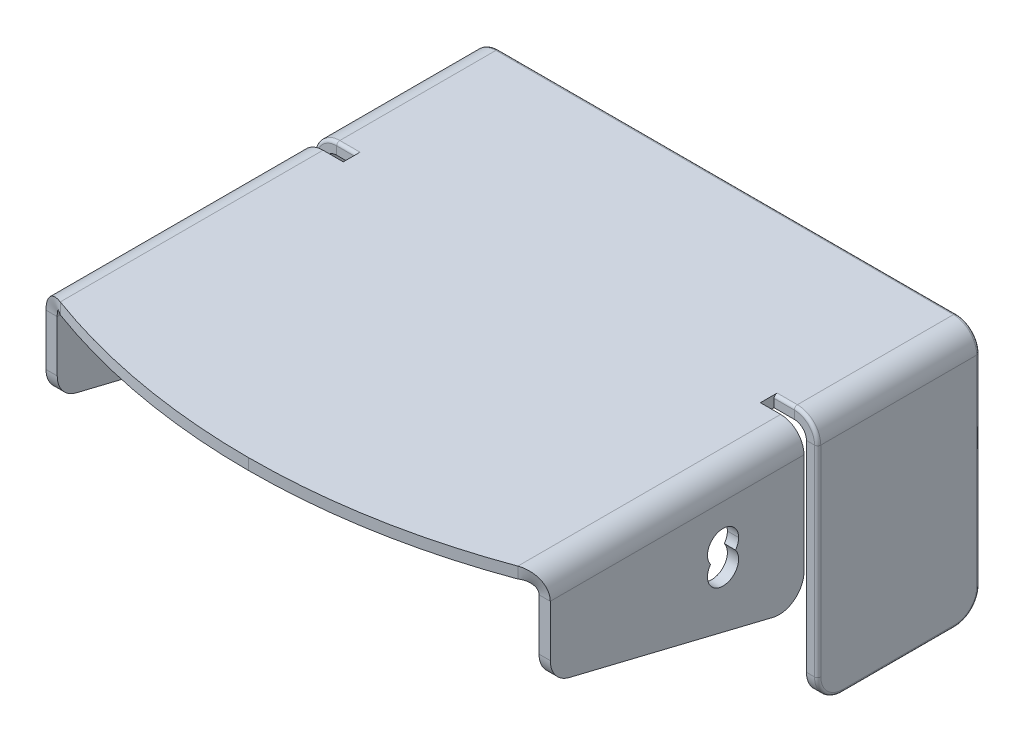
ISO-10303-21;
HEADER;
FILE_DESCRIPTION(('STEP AP214'),'2;1');
FILE_NAME('part.step','',(''),(''),'','','');
FILE_SCHEMA(('AUTOMOTIVE_DESIGN { 1 0 10303 214 1 1 1 1 }'));
ENDSEC;
DATA;
#1=APPLICATION_CONTEXT('core data for automotive mechanical design processes');
#2=APPLICATION_PROTOCOL_DEFINITION('international standard','automotive_design',2000,#1);
#3=PRODUCT_CONTEXT('',#1,'mechanical');
#4=PRODUCT('Part','Part','',(#3));
#5=PRODUCT_RELATED_PRODUCT_CATEGORY('part','',(#4));
#6=PRODUCT_DEFINITION_FORMATION('','',#4);
#7=PRODUCT_DEFINITION_CONTEXT('part definition',#1,'design');
#8=PRODUCT_DEFINITION('design','',#6,#7);
#9=PRODUCT_DEFINITION_SHAPE('','',#8);
#10=(LENGTH_UNIT() NAMED_UNIT(*) SI_UNIT(.MILLI.,.METRE.));
#11=(NAMED_UNIT(*) PLANE_ANGLE_UNIT() SI_UNIT($,.RADIAN.));
#12=(NAMED_UNIT(*) SI_UNIT($,.STERADIAN.) SOLID_ANGLE_UNIT());
#13=UNCERTAINTY_MEASURE_WITH_UNIT(LENGTH_MEASURE(1.E-05),#10,'distance_accuracy_value','');
#14=(GEOMETRIC_REPRESENTATION_CONTEXT(3) GLOBAL_UNCERTAINTY_ASSIGNED_CONTEXT((#13)) GLOBAL_UNIT_ASSIGNED_CONTEXT((#10,
#11,#12)) REPRESENTATION_CONTEXT('',''));
#15=CARTESIAN_POINT('',(0.,0.,0.));
#16=DIRECTION('',(0.,0.,1.));
#17=DIRECTION('',(1.,0.,0.));
#18=AXIS2_PLACEMENT_3D('',#15,#16,#17);
#19=CARTESIAN_POINT('',(38.7,-10.,41.25));
#20=DIRECTION('',(1.,0.,0.));
#21=DIRECTION('',(0.,0.,-1.));
#22=AXIS2_PLACEMENT_3D('',#19,#20,#21);
#23=CYLINDRICAL_SURFACE('',#22,2.5);
#24=CARTESIAN_POINT('',(38.7,-10.,41.25));
#25=DIRECTION('',(1.,0.,0.));
#26=DIRECTION('',(0.,0.,-1.));
#27=AXIS2_PLACEMENT_3D('',#24,#25,#26);
#28=CIRCLE('',#27,2.5);
#29=CARTESIAN_POINT('',(38.7,-11.5,39.25));
#30=VERTEX_POINT('',#29);
#31=CARTESIAN_POINT('',(38.7,-10.,38.75));
#32=VERTEX_POINT('',#31);
#33=EDGE_CURVE('E894',#30,#32,#28,.T.);
#34=ORIENTED_EDGE('',*,*,#33,.F.);
#35=DIRECTION('',(1.,0.,0.));
#36=VECTOR('',#35,1.);
#37=CARTESIAN_POINT('',(-0.00125000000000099,-11.5,39.25));
#38=LINE('',#37,#36);
#39=CARTESIAN_POINT('',(40.5,-11.5,39.25));
#40=VERTEX_POINT('',#39);
#41=EDGE_CURVE('E895',#30,#40,#38,.T.);
#42=ORIENTED_EDGE('',*,*,#41,.T.);
#43=CARTESIAN_POINT('',(40.5,-10.,41.25));
#44=DIRECTION('',(1.,0.,0.));
#45=DIRECTION('',(0.,0.,-1.));
#46=AXIS2_PLACEMENT_3D('',#43,#44,#45);
#47=CIRCLE('',#46,2.5);
#48=CARTESIAN_POINT('',(40.5,-10.,38.75));
#49=VERTEX_POINT('',#48);
#50=EDGE_CURVE('E502',#40,#49,#47,.T.);
#51=ORIENTED_EDGE('',*,*,#50,.T.);
#52=DIRECTION('',(1.,0.,0.));
#53=VECTOR('',#52,1.);
#54=CARTESIAN_POINT('',(38.7,-10.,38.75));
#55=LINE('',#54,#53);
#56=EDGE_CURVE('E509',#32,#49,#55,.T.);
#57=ORIENTED_EDGE('',*,*,#56,.F.);
#58=EDGE_LOOP('',(#34,#42,#51,#57));
#59=FACE_BOUND('',#58,.T.);
#60=ADVANCED_FACE('F46',(#59),#23,.F.);
#61=CARTESIAN_POINT('',(-38.7,-10.,41.25));
#62=DIRECTION('',(-1.,0.,0.));
#63=DIRECTION('',(0.,0.,1.));
#64=AXIS2_PLACEMENT_3D('',#61,#62,#63);
#65=CYLINDRICAL_SURFACE('',#64,2.5);
#66=CARTESIAN_POINT('',(-38.7,-10.,41.25));
#67=DIRECTION('',(1.,0.,0.));
#68=DIRECTION('',(0.,0.,-1.));
#69=AXIS2_PLACEMENT_3D('',#66,#67,#68);
#70=CIRCLE('',#69,2.5);
#71=CARTESIAN_POINT('',(-38.7,-10.,43.75));
#72=VERTEX_POINT('',#71);
#73=CARTESIAN_POINT('',(-38.7,-11.5,43.25));
#74=VERTEX_POINT('',#73);
#75=EDGE_CURVE('E1006',#72,#74,#70,.T.);
#76=ORIENTED_EDGE('',*,*,#75,.T.);
#77=DIRECTION('',(1.,0.,0.));
#78=VECTOR('',#77,1.);
#79=CARTESIAN_POINT('',(-0.00125000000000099,-11.5,43.25));
#80=LINE('',#79,#78);
#81=CARTESIAN_POINT('',(-40.5,-11.5,43.25));
#82=VERTEX_POINT('',#81);
#83=EDGE_CURVE('E11',#74,#82,#80,.F.);
#84=ORIENTED_EDGE('',*,*,#83,.T.);
#85=CARTESIAN_POINT('',(-40.5,-10.,41.25));
#86=DIRECTION('',(1.,0.,0.));
#87=DIRECTION('',(0.,0.,-1.));
#88=AXIS2_PLACEMENT_3D('',#85,#86,#87);
#89=CIRCLE('',#88,2.5);
#90=CARTESIAN_POINT('',(-40.5,-10.,43.75));
#91=VERTEX_POINT('',#90);
#92=EDGE_CURVE('E903',#91,#82,#89,.T.);
#93=ORIENTED_EDGE('',*,*,#92,.F.);
#94=DIRECTION('',(-1.,0.,0.));
#95=VECTOR('',#94,1.);
#96=CARTESIAN_POINT('',(-38.7,-10.,43.75));
#97=LINE('',#96,#95);
#98=EDGE_CURVE('E898',#72,#91,#97,.T.);
#99=ORIENTED_EDGE('',*,*,#98,.F.);
#100=EDGE_LOOP('',(#76,#84,#93,#99));
#101=FACE_BOUND('',#100,.T.);
#102=ADVANCED_FACE('F885',(#101),#65,.F.);
#103=CARTESIAN_POINT('',(-40.5,-20.,32.25));
#104=DIRECTION('',(1.,0.,0.));
#105=DIRECTION('',(0.,0.,-1.));
#106=AXIS2_PLACEMENT_3D('',#103,#104,#105);
#107=CYLINDRICAL_SURFACE('',#106,4.);
#108=CARTESIAN_POINT('',(-38.7,-20.,32.25));
#109=DIRECTION('',(1.,0.,0.));
#110=DIRECTION('',(0.,0.,-1.));
#111=AXIS2_PLACEMENT_3D('',#108,#109,#110);
#112=CIRCLE('',#111,4.);
#113=CARTESIAN_POINT('',(-38.7,-23.8857480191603,33.1991903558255));
#114=VERTEX_POINT('',#113);
#115=CARTESIAN_POINT('',(-38.7,-20.,28.25));
#116=VERTEX_POINT('',#115);
#117=EDGE_CURVE('E1108',#114,#116,#112,.T.);
#118=ORIENTED_EDGE('',*,*,#117,.F.);
#119=DIRECTION('',(1.,0.,0.));
#120=VECTOR('',#119,1.);
#121=CARTESIAN_POINT('',(-40.5,-23.8857480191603,33.1991903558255));
#122=LINE('',#121,#120);
#123=CARTESIAN_POINT('',(-40.5,-23.8857480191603,33.1991903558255));
#124=VERTEX_POINT('',#123);
#125=EDGE_CURVE('E1272',#124,#114,#122,.T.);
#126=ORIENTED_EDGE('',*,*,#125,.F.);
#127=CARTESIAN_POINT('',(-40.5,-20.,32.25));
#128=DIRECTION('',(1.,0.,0.));
#129=DIRECTION('',(0.,0.,-1.));
#130=AXIS2_PLACEMENT_3D('',#127,#128,#129);
#131=CIRCLE('',#130,4.);
#132=CARTESIAN_POINT('',(-40.5,-20.,28.25));
#133=VERTEX_POINT('',#132);
#134=EDGE_CURVE('E1181',#124,#133,#131,.T.);
#135=ORIENTED_EDGE('',*,*,#134,.T.);
#136=DIRECTION('',(1.,0.,0.));
#137=VECTOR('',#136,1.);
#138=CARTESIAN_POINT('',(-40.5,-20.,28.25));
#139=LINE('',#138,#137);
#140=EDGE_CURVE('E1296',#133,#116,#139,.T.);
#141=ORIENTED_EDGE('',*,*,#140,.T.);
#142=EDGE_LOOP('',(#118,#126,#135,#141));
#143=FACE_BOUND('',#142,.T.);
#144=ADVANCED_FACE('F655',(#143),#107,.T.);
#145=CARTESIAN_POINT('',(-40.5,-30.1938041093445,7.3755857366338));
#146=DIRECTION('',(0.,-0.97143700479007,0.237297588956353));
#147=DIRECTION('',(-1.,0.,0.));
#148=AXIS2_PLACEMENT_3D('',#145,#146,#147);
#149=PLANE('',#148);
#150=DIRECTION('',(0.,-0.237297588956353,-0.97143700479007));
#151=VECTOR('',#150,1.);
#152=CARTESIAN_POINT('',(-38.7,-30.1938041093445,7.3755857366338));
#153=LINE('',#152,#151);
#154=CARTESIAN_POINT('',(-38.7,-15.8857480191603,65.9491903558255));
#155=VERTEX_POINT('',#154);
#156=EDGE_CURVE('E1115',#155,#114,#153,.T.);
#157=ORIENTED_EDGE('',*,*,#156,.F.);
#158=DIRECTION('',(1.,0.,0.));
#159=VECTOR('',#158,1.);
#160=CARTESIAN_POINT('',(-40.5,-15.8857480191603,65.9491903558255));
#161=LINE('',#160,#159);
#162=CARTESIAN_POINT('',(-40.5,-15.8857480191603,65.9491903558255));
#163=VERTEX_POINT('',#162);
#164=EDGE_CURVE('E1269',#163,#155,#161,.T.);
#165=ORIENTED_EDGE('',*,*,#164,.F.);
#166=DIRECTION('',(0.,-0.237297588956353,-0.97143700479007));
#167=VECTOR('',#166,1.);
#168=CARTESIAN_POINT('',(-40.5,-30.1938041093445,7.3755857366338));
#169=LINE('',#168,#167);
#170=EDGE_CURVE('E909',#163,#124,#169,.T.);
#171=ORIENTED_EDGE('',*,*,#170,.T.);
#172=ORIENTED_EDGE('',*,*,#125,.T.);
#173=EDGE_LOOP('',(#157,#165,#171,#172));
#174=FACE_BOUND('',#173,.T.);
#175=ADVANCED_FACE('F744',(#174),#149,.T.);
#176=CARTESIAN_POINT('',(-40.5,-12.,65.));
#177=DIRECTION('',(1.,0.,0.));
#178=DIRECTION('',(0.,0.,-1.));
#179=AXIS2_PLACEMENT_3D('',#176,#177,#178);
#180=CYLINDRICAL_SURFACE('',#179,4.);
#181=CARTESIAN_POINT('',(-38.7,-12.,65.));
#182=DIRECTION('',(1.,0.,0.));
#183=DIRECTION('',(0.,0.,-1.));
#184=AXIS2_PLACEMENT_3D('',#181,#182,#183);
#185=CIRCLE('',#184,4.);
#186=CARTESIAN_POINT('',(-38.7,-12.,69.));
#187=VERTEX_POINT('',#186);
#188=EDGE_CURVE('E1119',#187,#155,#185,.T.);
#189=ORIENTED_EDGE('',*,*,#188,.F.);
#190=DIRECTION('',(1.,0.,0.));
#191=VECTOR('',#190,1.);
#192=CARTESIAN_POINT('',(-40.5,-12.,69.));
#193=LINE('',#192,#191);
#194=CARTESIAN_POINT('',(-40.5,-12.,69.));
#195=VERTEX_POINT('',#194);
#196=EDGE_CURVE('E951',#195,#187,#193,.T.);
#197=ORIENTED_EDGE('',*,*,#196,.F.);
#198=CARTESIAN_POINT('',(-40.5,-12.,65.));
#199=DIRECTION('',(1.,0.,0.));
#200=DIRECTION('',(0.,0.,-1.));
#201=AXIS2_PLACEMENT_3D('',#198,#199,#200);
#202=CIRCLE('',#201,4.);
#203=EDGE_CURVE('E913',#195,#163,#202,.T.);
#204=ORIENTED_EDGE('',*,*,#203,.T.);
#205=ORIENTED_EDGE('',*,*,#164,.T.);
#206=EDGE_LOOP('',(#189,#197,#204,#205));
#207=FACE_BOUND('',#206,.T.);
#208=ADVANCED_FACE('F747',(#207),#180,.T.);
#209=CARTESIAN_POINT('',(-40.5,-0.5,25.55));
#210=DIRECTION('',(1.,0.,0.));
#211=DIRECTION('',(0.,0.,-1.));
#212=AXIS2_PLACEMENT_3D('',#209,#210,#211);
#213=CYLINDRICAL_SURFACE('',#212,0.5);
#214=CARTESIAN_POINT('',(-36.75,-0.5,25.55));
#215=DIRECTION('',(1.,0.,0.));
#216=DIRECTION('',(0.,0.,-1.));
#217=AXIS2_PLACEMENT_3D('',#214,#215,#216);
#218=CIRCLE('',#217,0.5);
#219=CARTESIAN_POINT('',(-36.75,0.,25.55));
#220=VERTEX_POINT('',#219);
#221=CARTESIAN_POINT('',(-36.75,-0.5,26.05));
#222=VERTEX_POINT('',#221);
#223=EDGE_CURVE('E1150',#220,#222,#218,.T.);
#224=ORIENTED_EDGE('',*,*,#223,.T.);
#225=DIRECTION('',(-1.,0.,0.));
#226=VECTOR('',#225,1.);
#227=CARTESIAN_POINT('',(-40.5,-0.5,26.05));
#228=LINE('',#227,#226);
#229=CARTESIAN_POINT('',(-33.5,-0.5,26.05));
#230=VERTEX_POINT('',#229);
#231=EDGE_CURVE('E1064',#230,#222,#228,.T.);
#232=ORIENTED_EDGE('',*,*,#231,.F.);
#233=CARTESIAN_POINT('',(-33.5,-0.5,25.55));
#234=DIRECTION('',(1.,0.,0.));
#235=DIRECTION('',(0.,-1.,0.));
#236=AXIS2_PLACEMENT_3D('',#233,#234,#235);
#237=CIRCLE('',#236,0.5);
#238=CARTESIAN_POINT('',(-33.5,0.,25.55));
#239=VERTEX_POINT('',#238);
#240=EDGE_CURVE('E1017',#239,#230,#237,.T.);
#241=ORIENTED_EDGE('',*,*,#240,.F.);
#242=DIRECTION('',(1.,0.,0.));
#243=VECTOR('',#242,1.);
#244=CARTESIAN_POINT('',(-40.5,0.,25.55));
#245=LINE('',#244,#243);
#246=EDGE_CURVE('E1109',#220,#239,#245,.T.);
#247=ORIENTED_EDGE('',*,*,#246,.F.);
#248=EDGE_LOOP('',(#224,#232,#241,#247));
#249=FACE_BOUND('',#248,.T.);
#250=ADVANCED_FACE('F754',(#249),#213,.T.);
#251=CARTESIAN_POINT('',(-36.75,-3.75,25.55));
#252=DIRECTION('',(0.,0.,1.));
#253=DIRECTION('',(0.,-1.,0.));
#254=AXIS2_PLACEMENT_3D('',#251,#252,#253);
#255=TOROIDAL_SURFACE('',#254,3.25,0.5);
#256=CARTESIAN_POINT('',(-40.,-3.75,25.55));
#257=DIRECTION('',(0.,1.,0.));
#258=DIRECTION('',(0.,0.,1.));
#259=AXIS2_PLACEMENT_3D('',#256,#257,#258);
#260=CIRCLE('',#259,0.5);
#261=CARTESIAN_POINT('',(-40.5,-3.75,25.55));
#262=VERTEX_POINT('',#261);
#263=CARTESIAN_POINT('',(-40.,-3.75,26.05));
#264=VERTEX_POINT('',#263);
#265=EDGE_CURVE('E1147',#262,#264,#260,.T.);
#266=ORIENTED_EDGE('',*,*,#265,.T.);
#267=CARTESIAN_POINT('',(-36.75,-3.75,26.05));
#268=DIRECTION('',(0.,0.,1.));
#269=DIRECTION('',(0.,-1.,0.));
#270=AXIS2_PLACEMENT_3D('',#267,#268,#269);
#271=CIRCLE('',#270,3.25);
#272=EDGE_CURVE('E1021',#222,#264,#271,.T.);
#273=ORIENTED_EDGE('',*,*,#272,.F.);
#274=ORIENTED_EDGE('',*,*,#223,.F.);
#275=CARTESIAN_POINT('',(-36.75,-3.75,25.55));
#276=DIRECTION('',(0.,0.,-1.));
#277=DIRECTION('',(0.,-1.,0.));
#278=AXIS2_PLACEMENT_3D('',#275,#276,#277);
#279=CIRCLE('',#278,3.75);
#280=EDGE_CURVE('E975',#262,#220,#279,.T.);
#281=ORIENTED_EDGE('',*,*,#280,.F.);
#282=EDGE_LOOP('',(#266,#273,#274,#281));
#283=FACE_BOUND('',#282,.T.);
#284=ADVANCED_FACE('F563',(#283),#255,.T.);
#285=CARTESIAN_POINT('',(-40.,0.,25.55));
#286=DIRECTION('',(0.,1.,0.));
#287=DIRECTION('',(-1.,0.,0.));
#288=AXIS2_PLACEMENT_3D('',#285,#286,#287);
#289=CYLINDRICAL_SURFACE('',#288,0.5);
#290=CARTESIAN_POINT('',(-40.,-36.,25.55));
#291=DIRECTION('',(0.,1.,0.));
#292=DIRECTION('',(0.,0.,1.));
#293=AXIS2_PLACEMENT_3D('',#290,#291,#292);
#294=CIRCLE('',#293,0.5);
#295=CARTESIAN_POINT('',(-40.5,-36.,25.55));
#296=VERTEX_POINT('',#295);
#297=CARTESIAN_POINT('',(-40.,-36.,26.05));
#298=VERTEX_POINT('',#297);
#299=EDGE_CURVE('E1035',#296,#298,#294,.T.);
#300=ORIENTED_EDGE('',*,*,#299,.T.);
#301=DIRECTION('',(0.,-1.,0.));
#302=VECTOR('',#301,1.);
#303=CARTESIAN_POINT('',(-40.,-40.001,26.05));
#304=LINE('',#303,#302);
#305=EDGE_CURVE('E973',#264,#298,#304,.T.);
#306=ORIENTED_EDGE('',*,*,#305,.F.);
#307=ORIENTED_EDGE('',*,*,#265,.F.);
#308=DIRECTION('',(0.,1.,0.));
#309=VECTOR('',#308,1.);
#310=CARTESIAN_POINT('',(-40.5,0.,25.55));
#311=LINE('',#310,#309);
#312=EDGE_CURVE('E1191',#296,#262,#311,.T.);
#313=ORIENTED_EDGE('',*,*,#312,.F.);
#314=EDGE_LOOP('',(#300,#306,#307,#313));
#315=FACE_BOUND('',#314,.T.);
#316=ADVANCED_FACE('F559',(#315),#289,.T.);
#317=CARTESIAN_POINT('',(-40.,-36.,22.05));
#318=DIRECTION('',(-1.,0.,0.));
#319=DIRECTION('',(0.,-1.,0.));
#320=AXIS2_PLACEMENT_3D('',#317,#318,#319);
#321=TOROIDAL_SURFACE('',#320,3.5,0.5);
#322=CARTESIAN_POINT('',(-40.,-39.5,22.05));
#323=DIRECTION('',(0.,0.,1.));
#324=DIRECTION('',(1.,0.,0.));
#325=AXIS2_PLACEMENT_3D('',#322,#323,#324);
#326=CIRCLE('',#325,0.5);
#327=CARTESIAN_POINT('',(-40.5,-39.5,22.05));
#328=VERTEX_POINT('',#327);
#329=CARTESIAN_POINT('',(-40.,-40.,22.05));
#330=VERTEX_POINT('',#329);
#331=EDGE_CURVE('E1032',#328,#330,#326,.T.);
#332=ORIENTED_EDGE('',*,*,#331,.T.);
#333=CARTESIAN_POINT('',(-40.,-36.,22.05));
#334=DIRECTION('',(1.,0.,0.));
#335=DIRECTION('',(0.,-1.,0.));
#336=AXIS2_PLACEMENT_3D('',#333,#334,#335);
#337=CIRCLE('',#336,4.);
#338=EDGE_CURVE('E1135',#298,#330,#337,.T.);
#339=ORIENTED_EDGE('',*,*,#338,.F.);
#340=ORIENTED_EDGE('',*,*,#299,.F.);
#341=CARTESIAN_POINT('',(-40.5,-36.,22.05));
#342=DIRECTION('',(-1.,0.,0.));
#343=DIRECTION('',(0.,-1.,0.));
#344=AXIS2_PLACEMENT_3D('',#341,#342,#343);
#345=CIRCLE('',#344,3.5);
#346=EDGE_CURVE('E1025',#328,#296,#345,.T.);
#347=ORIENTED_EDGE('',*,*,#346,.F.);
#348=EDGE_LOOP('',(#332,#339,#340,#347));
#349=FACE_BOUND('',#348,.T.);
#350=ADVANCED_FACE('F562',(#349),#321,.T.);
#351=CARTESIAN_POINT('',(-40.,-39.5,77.));
#352=DIRECTION('',(0.,0.,-1.));
#353=DIRECTION('',(-1.,0.,0.));
#354=AXIS2_PLACEMENT_3D('',#351,#352,#353);
#355=CYLINDRICAL_SURFACE('',#354,0.5);
#356=CARTESIAN_POINT('',(-40.,-39.5,4.));
#357=DIRECTION('',(0.,0.,1.));
#358=DIRECTION('',(1.,0.,0.));
#359=AXIS2_PLACEMENT_3D('',#356,#357,#358);
#360=CIRCLE('',#359,0.5);
#361=CARTESIAN_POINT('',(-40.5,-39.5,4.));
#362=VERTEX_POINT('',#361);
#363=CARTESIAN_POINT('',(-40.,-40.,4.));
#364=VERTEX_POINT('',#363);
#365=EDGE_CURVE('E1036',#362,#364,#360,.T.);
#366=ORIENTED_EDGE('',*,*,#365,.T.);
#367=DIRECTION('',(0.,0.,-1.));
#368=VECTOR('',#367,1.);
#369=CARTESIAN_POINT('',(-40.,-40.,77.));
#370=LINE('',#369,#368);
#371=EDGE_CURVE('E958',#330,#364,#370,.T.);
#372=ORIENTED_EDGE('',*,*,#371,.F.);
#373=ORIENTED_EDGE('',*,*,#331,.F.);
#374=DIRECTION('',(0.,0.,1.));
#375=VECTOR('',#374,1.);
#376=CARTESIAN_POINT('',(-40.5,-39.5,77.));
#377=LINE('',#376,#375);
#378=EDGE_CURVE('E921',#362,#328,#377,.T.);
#379=ORIENTED_EDGE('',*,*,#378,.F.);
#380=EDGE_LOOP('',(#366,#372,#373,#379));
#381=FACE_BOUND('',#380,.T.);
#382=ADVANCED_FACE('F669',(#381),#355,.T.);
#383=CARTESIAN_POINT('',(-40.,-36.,4.));
#384=DIRECTION('',(-1.,0.,0.));
#385=DIRECTION('',(0.,-1.,0.));
#386=AXIS2_PLACEMENT_3D('',#383,#384,#385);
#387=TOROIDAL_SURFACE('',#386,3.5,0.5);
#388=CARTESIAN_POINT('',(-40.,-36.,0.5));
#389=DIRECTION('',(0.,-1.,0.));
#390=DIRECTION('',(0.,0.,-1.));
#391=AXIS2_PLACEMENT_3D('',#388,#389,#390);
#392=CIRCLE('',#391,0.5);
#393=CARTESIAN_POINT('',(-40.5,-36.,0.5));
#394=VERTEX_POINT('',#393);
#395=CARTESIAN_POINT('',(-40.,-36.,0.));
#396=VERTEX_POINT('',#395);
#397=EDGE_CURVE('E1457',#394,#396,#392,.T.);
#398=ORIENTED_EDGE('',*,*,#397,.T.);
#399=CARTESIAN_POINT('',(-40.,-36.,4.));
#400=DIRECTION('',(1.,0.,0.));
#401=DIRECTION('',(0.,-1.,0.));
#402=AXIS2_PLACEMENT_3D('',#399,#400,#401);
#403=CIRCLE('',#402,4.);
#404=EDGE_CURVE('E1020',#364,#396,#403,.T.);
#405=ORIENTED_EDGE('',*,*,#404,.F.);
#406=ORIENTED_EDGE('',*,*,#365,.F.);
#407=CARTESIAN_POINT('',(-40.5,-36.,4.));
#408=DIRECTION('',(-1.,0.,0.));
#409=DIRECTION('',(0.,-1.,0.));
#410=AXIS2_PLACEMENT_3D('',#407,#408,#409);
#411=CIRCLE('',#410,3.5);
#412=EDGE_CURVE('E926',#394,#362,#411,.T.);
#413=ORIENTED_EDGE('',*,*,#412,.F.);
#414=EDGE_LOOP('',(#398,#405,#406,#413));
#415=FACE_BOUND('',#414,.T.);
#416=ADVANCED_FACE('F672',(#415),#387,.T.);
#417=CARTESIAN_POINT('',(-40.,-1.8,0.5));
#418=DIRECTION('',(0.,1.,0.));
#419=DIRECTION('',(-1.,0.,0.));
#420=AXIS2_PLACEMENT_3D('',#417,#418,#419);
#421=CYLINDRICAL_SURFACE('',#420,0.5);
#422=CARTESIAN_POINT('',(-40.,-3.75,0.5));
#423=DIRECTION('',(0.,-1.,0.));
#424=DIRECTION('',(0.,0.,-1.));
#425=AXIS2_PLACEMENT_3D('',#422,#423,#424);
#426=CIRCLE('',#425,0.5);
#427=CARTESIAN_POINT('',(-40.5,-3.75,0.5));
#428=VERTEX_POINT('',#427);
#429=CARTESIAN_POINT('',(-40.,-3.75,0.));
#430=VERTEX_POINT('',#429);
#431=EDGE_CURVE('E1382',#428,#430,#426,.T.);
#432=ORIENTED_EDGE('',*,*,#431,.T.);
#433=DIRECTION('',(0.,1.,0.));
#434=VECTOR('',#433,1.);
#435=CARTESIAN_POINT('',(-40.,-1.8,0.));
#436=LINE('',#435,#434);
#437=EDGE_CURVE('E1250',#396,#430,#436,.T.);
#438=ORIENTED_EDGE('',*,*,#437,.F.);
#439=ORIENTED_EDGE('',*,*,#397,.F.);
#440=DIRECTION('',(0.,-1.,0.));
#441=VECTOR('',#440,1.);
#442=CARTESIAN_POINT('',(-40.5,0.,0.5));
#443=LINE('',#442,#441);
#444=EDGE_CURVE('E1187',#428,#394,#443,.T.);
#445=ORIENTED_EDGE('',*,*,#444,.F.);
#446=EDGE_LOOP('',(#432,#438,#439,#445));
#447=FACE_BOUND('',#446,.T.);
#448=ADVANCED_FACE('F1745',(#447),#421,.T.);
#449=CARTESIAN_POINT('',(-36.75,-3.75,0.5));
#450=DIRECTION('',(0.,0.,-1.));
#451=DIRECTION('',(-1.,0.,0.));
#452=AXIS2_PLACEMENT_3D('',#449,#450,#451);
#453=TOROIDAL_SURFACE('',#452,3.25,0.5);
#454=CARTESIAN_POINT('',(-36.75,-0.5,0.5));
#455=DIRECTION('',(-1.,0.,0.));
#456=DIRECTION('',(0.,0.,1.));
#457=AXIS2_PLACEMENT_3D('',#454,#455,#456);
#458=CIRCLE('',#457,0.5);
#459=CARTESIAN_POINT('',(-36.75,0.,0.5));
#460=VERTEX_POINT('',#459);
#461=CARTESIAN_POINT('',(-36.75,-0.5,0.));
#462=VERTEX_POINT('',#461);
#463=EDGE_CURVE('E1263',#460,#462,#458,.T.);
#464=ORIENTED_EDGE('',*,*,#463,.T.);
#465=CARTESIAN_POINT('',(-36.75,-3.75,0.));
#466=DIRECTION('',(0.,0.,-1.));
#467=DIRECTION('',(-1.,0.,0.));
#468=AXIS2_PLACEMENT_3D('',#465,#466,#467);
#469=CIRCLE('',#468,3.25);
#470=EDGE_CURVE('E1000',#430,#462,#469,.T.);
#471=ORIENTED_EDGE('',*,*,#470,.F.);
#472=ORIENTED_EDGE('',*,*,#431,.F.);
#473=CARTESIAN_POINT('',(-36.75,-3.75,0.5));
#474=DIRECTION('',(0.,0.,1.));
#475=DIRECTION('',(-1.,0.,0.));
#476=AXIS2_PLACEMENT_3D('',#473,#474,#475);
#477=CIRCLE('',#476,3.75);
#478=EDGE_CURVE('E979',#460,#428,#477,.T.);
#479=ORIENTED_EDGE('',*,*,#478,.F.);
#480=EDGE_LOOP('',(#464,#471,#472,#479));
#481=FACE_BOUND('',#480,.T.);
#482=ADVANCED_FACE('F589',(#481),#453,.T.);
#483=CARTESIAN_POINT('',(38.7,-0.5,0.5));
#484=DIRECTION('',(1.,0.,0.));
#485=DIRECTION('',(0.,0.,-1.));
#486=AXIS2_PLACEMENT_3D('',#483,#484,#485);
#487=CYLINDRICAL_SURFACE('',#486,0.5);
#488=CARTESIAN_POINT('',(36.75,-0.5,0.5));
#489=DIRECTION('',(-1.,0.,0.));
#490=DIRECTION('',(0.,0.,1.));
#491=AXIS2_PLACEMENT_3D('',#488,#489,#490);
#492=CIRCLE('',#491,0.5);
#493=CARTESIAN_POINT('',(36.75,0.,0.5));
#494=VERTEX_POINT('',#493);
#495=CARTESIAN_POINT('',(36.75,-0.5,0.));
#496=VERTEX_POINT('',#495);
#497=EDGE_CURVE('E1260',#494,#496,#492,.T.);
#498=ORIENTED_EDGE('',*,*,#497,.T.);
#499=DIRECTION('',(1.,0.,0.));
#500=VECTOR('',#499,1.);
#501=CARTESIAN_POINT('',(38.7,-0.5,0.));
#502=LINE('',#501,#500);
#503=EDGE_CURVE('E993',#462,#496,#502,.T.);
#504=ORIENTED_EDGE('',*,*,#503,.F.);
#505=ORIENTED_EDGE('',*,*,#463,.F.);
#506=DIRECTION('',(-1.,0.,0.));
#507=VECTOR('',#506,1.);
#508=CARTESIAN_POINT('',(-40.5,0.,0.5));
#509=LINE('',#508,#507);
#510=EDGE_CURVE('E1126',#494,#460,#509,.T.);
#511=ORIENTED_EDGE('',*,*,#510,.F.);
#512=EDGE_LOOP('',(#498,#504,#505,#511));
#513=FACE_BOUND('',#512,.T.);
#514=ADVANCED_FACE('F557',(#513),#487,.T.);
#515=CARTESIAN_POINT('',(36.75,-3.75,0.5));
#516=DIRECTION('',(0.,0.,-1.));
#517=DIRECTION('',(-1.,0.,0.));
#518=AXIS2_PLACEMENT_3D('',#515,#516,#517);
#519=TOROIDAL_SURFACE('',#518,3.25,0.5);
#520=CARTESIAN_POINT('',(40.,-3.75,0.5));
#521=DIRECTION('',(0.,1.,0.));
#522=DIRECTION('',(0.,0.,1.));
#523=AXIS2_PLACEMENT_3D('',#520,#521,#522);
#524=CIRCLE('',#523,0.5);
#525=CARTESIAN_POINT('',(40.5,-3.75,0.5));
#526=VERTEX_POINT('',#525);
#527=CARTESIAN_POINT('',(40.,-3.75,0.));
#528=VERTEX_POINT('',#527);
#529=EDGE_CURVE('E1264',#526,#528,#524,.T.);
#530=ORIENTED_EDGE('',*,*,#529,.T.);
#531=CARTESIAN_POINT('',(36.75,-3.75,0.));
#532=DIRECTION('',(0.,0.,-1.));
#533=DIRECTION('',(-1.,0.,0.));
#534=AXIS2_PLACEMENT_3D('',#531,#532,#533);
#535=CIRCLE('',#534,3.25);
#536=EDGE_CURVE('E1071',#496,#528,#535,.T.);
#537=ORIENTED_EDGE('',*,*,#536,.F.);
#538=ORIENTED_EDGE('',*,*,#497,.F.);
#539=CARTESIAN_POINT('',(36.75,-3.75,0.5));
#540=DIRECTION('',(0.,0.,1.));
#541=DIRECTION('',(-1.,0.,0.));
#542=AXIS2_PLACEMENT_3D('',#539,#540,#541);
#543=CIRCLE('',#542,3.75);
#544=EDGE_CURVE('E1232',#526,#494,#543,.T.);
#545=ORIENTED_EDGE('',*,*,#544,.F.);
#546=EDGE_LOOP('',(#530,#537,#538,#545));
#547=FACE_BOUND('',#546,.T.);
#548=ADVANCED_FACE('F553',(#547),#519,.T.);
#549=CARTESIAN_POINT('',(40.,-3.75,0.5));
#550=DIRECTION('',(0.,1.,0.));
#551=DIRECTION('',(-1.,0.,0.));
#552=AXIS2_PLACEMENT_3D('',#549,#550,#551);
#553=CYLINDRICAL_SURFACE('',#552,0.5);
#554=CARTESIAN_POINT('',(40.,-36.,0.5));
#555=DIRECTION('',(0.,1.,0.));
#556=DIRECTION('',(0.,0.,1.));
#557=AXIS2_PLACEMENT_3D('',#554,#555,#556);
#558=CIRCLE('',#557,0.5);
#559=CARTESIAN_POINT('',(40.5,-36.,0.5));
#560=VERTEX_POINT('',#559);
#561=CARTESIAN_POINT('',(40.,-36.,0.));
#562=VERTEX_POINT('',#561);
#563=EDGE_CURVE('E1427',#560,#562,#558,.T.);
#564=ORIENTED_EDGE('',*,*,#563,.T.);
#565=DIRECTION('',(0.,-1.,0.));
#566=VECTOR('',#565,1.);
#567=CARTESIAN_POINT('',(40.,-36.,0.));
#568=LINE('',#567,#566);
#569=EDGE_CURVE('E1120',#528,#562,#568,.T.);
#570=ORIENTED_EDGE('',*,*,#569,.F.);
#571=ORIENTED_EDGE('',*,*,#529,.F.);
#572=DIRECTION('',(0.,1.,0.));
#573=VECTOR('',#572,1.);
#574=CARTESIAN_POINT('',(40.5,-3.75,0.5));
#575=LINE('',#574,#573);
#576=EDGE_CURVE('E963',#560,#526,#575,.T.);
#577=ORIENTED_EDGE('',*,*,#576,.F.);
#578=EDGE_LOOP('',(#564,#570,#571,#577));
#579=FACE_BOUND('',#578,.T.);
#580=ADVANCED_FACE('F556',(#579),#553,.T.);
#581=CARTESIAN_POINT('',(40.,-36.,4.));
#582=DIRECTION('',(1.,0.,0.));
#583=DIRECTION('',(0.,1.,0.));
#584=AXIS2_PLACEMENT_3D('',#581,#582,#583);
#585=TOROIDAL_SURFACE('',#584,3.5,0.5);
#586=CARTESIAN_POINT('',(40.,-39.5,4.));
#587=DIRECTION('',(0.,0.,-1.));
#588=DIRECTION('',(-1.,0.,0.));
#589=AXIS2_PLACEMENT_3D('',#586,#587,#588);
#590=CIRCLE('',#589,0.5);
#591=CARTESIAN_POINT('',(40.5,-39.5,4.));
#592=VERTEX_POINT('',#591);
#593=CARTESIAN_POINT('',(40.,-40.,4.));
#594=VERTEX_POINT('',#593);
#595=EDGE_CURVE('E907',#592,#594,#590,.T.);
#596=ORIENTED_EDGE('',*,*,#595,.T.);
#597=CARTESIAN_POINT('',(40.,-36.,4.));
#598=DIRECTION('',(-1.,0.,0.));
#599=DIRECTION('',(0.,1.,0.));
#600=AXIS2_PLACEMENT_3D('',#597,#598,#599);
#601=CIRCLE('',#600,4.);
#602=EDGE_CURVE('E1098',#562,#594,#601,.T.);
#603=ORIENTED_EDGE('',*,*,#602,.F.);
#604=ORIENTED_EDGE('',*,*,#563,.F.);
#605=CARTESIAN_POINT('',(40.5,-36.,4.));
#606=DIRECTION('',(1.,0.,0.));
#607=DIRECTION('',(0.,1.,0.));
#608=AXIS2_PLACEMENT_3D('',#605,#606,#607);
#609=CIRCLE('',#608,3.5);
#610=EDGE_CURVE('E968',#592,#560,#609,.T.);
#611=ORIENTED_EDGE('',*,*,#610,.F.);
#612=EDGE_LOOP('',(#596,#603,#604,#611));
#613=FACE_BOUND('',#612,.T.);
#614=ADVANCED_FACE('F585',(#613),#585,.T.);
#615=CARTESIAN_POINT('',(40.,-39.5,77.));
#616=DIRECTION('',(0.,0.,-1.));
#617=DIRECTION('',(-1.,0.,0.));
#618=AXIS2_PLACEMENT_3D('',#615,#616,#617);
#619=CYLINDRICAL_SURFACE('',#618,0.5);
#620=CARTESIAN_POINT('',(40.,-39.5,22.05));
#621=DIRECTION('',(0.,0.,-1.));
#622=DIRECTION('',(-1.,0.,0.));
#623=AXIS2_PLACEMENT_3D('',#620,#621,#622);
#624=CIRCLE('',#623,0.5);
#625=CARTESIAN_POINT('',(40.5,-39.5,22.05));
#626=VERTEX_POINT('',#625);
#627=CARTESIAN_POINT('',(40.,-40.,22.05));
#628=VERTEX_POINT('',#627);
#629=EDGE_CURVE('E1057',#626,#628,#624,.T.);
#630=ORIENTED_EDGE('',*,*,#629,.T.);
#631=DIRECTION('',(0.,0.,1.));
#632=VECTOR('',#631,1.);
#633=CARTESIAN_POINT('',(40.,-40.,77.));
#634=LINE('',#633,#632);
#635=EDGE_CURVE('E1207',#594,#628,#634,.T.);
#636=ORIENTED_EDGE('',*,*,#635,.F.);
#637=ORIENTED_EDGE('',*,*,#595,.F.);
#638=DIRECTION('',(0.,0.,-1.));
#639=VECTOR('',#638,1.);
#640=CARTESIAN_POINT('',(40.5,-39.5,77.));
#641=LINE('',#640,#639);
#642=EDGE_CURVE('E1327',#626,#592,#641,.T.);
#643=ORIENTED_EDGE('',*,*,#642,.F.);
#644=EDGE_LOOP('',(#630,#636,#637,#643));
#645=FACE_BOUND('',#644,.T.);
#646=ADVANCED_FACE('F581',(#645),#619,.T.);
#647=CARTESIAN_POINT('',(40.,-36.,22.05));
#648=DIRECTION('',(1.,0.,0.));
#649=DIRECTION('',(0.,1.,0.));
#650=AXIS2_PLACEMENT_3D('',#647,#648,#649);
#651=TOROIDAL_SURFACE('',#650,3.5,0.5);
#652=CARTESIAN_POINT('',(40.,-36.,25.55));
#653=DIRECTION('',(0.,-1.,0.));
#654=DIRECTION('',(0.,0.,-1.));
#655=AXIS2_PLACEMENT_3D('',#652,#653,#654);
#656=CIRCLE('',#655,0.5);
#657=CARTESIAN_POINT('',(40.5,-36.,25.55));
#658=VERTEX_POINT('',#657);
#659=CARTESIAN_POINT('',(40.,-36.,26.05));
#660=VERTEX_POINT('',#659);
#661=EDGE_CURVE('E946',#658,#660,#656,.T.);
#662=ORIENTED_EDGE('',*,*,#661,.T.);
#663=CARTESIAN_POINT('',(40.,-36.,22.05));
#664=DIRECTION('',(-1.,0.,0.));
#665=DIRECTION('',(0.,1.,0.));
#666=AXIS2_PLACEMENT_3D('',#663,#664,#665);
#667=CIRCLE('',#666,4.);
#668=EDGE_CURVE('E1102',#628,#660,#667,.T.);
#669=ORIENTED_EDGE('',*,*,#668,.F.);
#670=ORIENTED_EDGE('',*,*,#629,.F.);
#671=CARTESIAN_POINT('',(40.5,-36.,22.05));
#672=DIRECTION('',(1.,0.,0.));
#673=DIRECTION('',(0.,1.,0.));
#674=AXIS2_PLACEMENT_3D('',#671,#672,#673);
#675=CIRCLE('',#674,3.5);
#676=EDGE_CURVE('E1352',#658,#626,#675,.T.);
#677=ORIENTED_EDGE('',*,*,#676,.F.);
#678=EDGE_LOOP('',(#662,#669,#670,#677));
#679=FACE_BOUND('',#678,.T.);
#680=ADVANCED_FACE('F584',(#679),#651,.T.);
#681=CARTESIAN_POINT('',(40.,-40.001,25.55));
#682=DIRECTION('',(0.,-1.,0.));
#683=DIRECTION('',(1.,0.,0.));
#684=AXIS2_PLACEMENT_3D('',#681,#682,#683);
#685=CYLINDRICAL_SURFACE('',#684,0.5);
#686=CARTESIAN_POINT('',(40.,-3.75,25.55));
#687=DIRECTION('',(0.,-1.,0.));
#688=DIRECTION('',(0.,0.,-1.));
#689=AXIS2_PLACEMENT_3D('',#686,#687,#688);
#690=CIRCLE('',#689,0.5);
#691=CARTESIAN_POINT('',(40.5,-3.75,25.55));
#692=VERTEX_POINT('',#691);
#693=CARTESIAN_POINT('',(40.,-3.75,26.05));
#694=VERTEX_POINT('',#693);
#695=EDGE_CURVE('E943',#692,#694,#690,.T.);
#696=ORIENTED_EDGE('',*,*,#695,.T.);
#697=DIRECTION('',(0.,1.,0.));
#698=VECTOR('',#697,1.);
#699=CARTESIAN_POINT('',(40.,-3.75,26.05));
#700=LINE('',#699,#698);
#701=EDGE_CURVE('E931',#660,#694,#700,.T.);
#702=ORIENTED_EDGE('',*,*,#701,.F.);
#703=ORIENTED_EDGE('',*,*,#661,.F.);
#704=DIRECTION('',(0.,-1.,0.));
#705=VECTOR('',#704,1.);
#706=CARTESIAN_POINT('',(40.5,-36.,25.55));
#707=LINE('',#706,#705);
#708=EDGE_CURVE('E1323',#692,#658,#707,.T.);
#709=ORIENTED_EDGE('',*,*,#708,.F.);
#710=EDGE_LOOP('',(#696,#702,#703,#709));
#711=FACE_BOUND('',#710,.T.);
#712=ADVANCED_FACE('F661',(#711),#685,.T.);
#713=CARTESIAN_POINT('',(36.75,-3.75,25.55));
#714=DIRECTION('',(0.,0.,-1.));
#715=DIRECTION('',(0.,1.,0.));
#716=AXIS2_PLACEMENT_3D('',#713,#714,#715);
#717=TOROIDAL_SURFACE('',#716,3.25,0.5);
#718=CARTESIAN_POINT('',(36.75,-0.5,25.55));
#719=DIRECTION('',(1.,0.,0.));
#720=DIRECTION('',(0.,0.,-1.));
#721=AXIS2_PLACEMENT_3D('',#718,#719,#720);
#722=CIRCLE('',#721,0.5);
#723=CARTESIAN_POINT('',(36.75,0.,25.55));
#724=VERTEX_POINT('',#723);
#725=CARTESIAN_POINT('',(36.75,-0.5,26.05));
#726=VERTEX_POINT('',#725);
#727=EDGE_CURVE('E947',#724,#726,#722,.T.);
#728=ORIENTED_EDGE('',*,*,#727,.T.);
#729=CARTESIAN_POINT('',(36.75,-3.75,26.05));
#730=DIRECTION('',(0.,0.,1.));
#731=DIRECTION('',(0.,1.,0.));
#732=AXIS2_PLACEMENT_3D('',#729,#730,#731);
#733=CIRCLE('',#732,3.25);
#734=EDGE_CURVE('E1146',#694,#726,#733,.T.);
#735=ORIENTED_EDGE('',*,*,#734,.F.);
#736=ORIENTED_EDGE('',*,*,#695,.F.);
#737=CARTESIAN_POINT('',(36.75,-3.75,25.55));
#738=DIRECTION('',(0.,0.,-1.));
#739=DIRECTION('',(0.,1.,0.));
#740=AXIS2_PLACEMENT_3D('',#737,#738,#739);
#741=CIRCLE('',#740,3.75);
#742=EDGE_CURVE('E967',#724,#692,#741,.T.);
#743=ORIENTED_EDGE('',*,*,#742,.F.);
#744=EDGE_LOOP('',(#728,#735,#736,#743));
#745=FACE_BOUND('',#744,.T.);
#746=ADVANCED_FACE('F657',(#745),#717,.T.);
#747=CARTESIAN_POINT('',(40.5,-0.5,25.55));
#748=DIRECTION('',(1.,0.,0.));
#749=DIRECTION('',(0.,0.,-1.));
#750=AXIS2_PLACEMENT_3D('',#747,#748,#749);
#751=CYLINDRICAL_SURFACE('',#750,0.5);
#752=CARTESIAN_POINT('',(33.5,-0.5,25.55));
#753=DIRECTION('',(-1.,0.,0.));
#754=DIRECTION('',(0.,-1.,0.));
#755=AXIS2_PLACEMENT_3D('',#752,#753,#754);
#756=CIRCLE('',#755,0.5);
#757=CARTESIAN_POINT('',(33.5,-0.5,26.05));
#758=VERTEX_POINT('',#757);
#759=CARTESIAN_POINT('',(33.5,0.,25.55));
#760=VERTEX_POINT('',#759);
#761=EDGE_CURVE('E1220',#758,#760,#756,.T.);
#762=ORIENTED_EDGE('',*,*,#761,.F.);
#763=DIRECTION('',(-1.,0.,0.));
#764=VECTOR('',#763,1.);
#765=CARTESIAN_POINT('',(33.5,-0.5,26.05));
#766=LINE('',#765,#764);
#767=EDGE_CURVE('E1140',#726,#758,#766,.T.);
#768=ORIENTED_EDGE('',*,*,#767,.F.);
#769=ORIENTED_EDGE('',*,*,#727,.F.);
#770=DIRECTION('',(1.,0.,0.));
#771=VECTOR('',#770,1.);
#772=CARTESIAN_POINT('',(36.75,0.,25.55));
#773=LINE('',#772,#771);
#774=EDGE_CURVE('E1175',#760,#724,#773,.T.);
#775=ORIENTED_EDGE('',*,*,#774,.F.);
#776=EDGE_LOOP('',(#762,#768,#769,#775));
#777=FACE_BOUND('',#776,.T.);
#778=ADVANCED_FACE('F660',(#777),#751,.T.);
#779=CARTESIAN_POINT('',(36.75,-36.,4.));
#780=DIRECTION('',(1.,0.,0.));
#781=DIRECTION('',(0.,0.,-1.));
#782=AXIS2_PLACEMENT_3D('',#779,#780,#781);
#783=CYLINDRICAL_SURFACE('',#782,4.);
#784=DIRECTION('',(-1.,0.,0.));
#785=VECTOR('',#784,1.);
#786=CARTESIAN_POINT('',(38.7,-36.,0.));
#787=LINE('',#786,#785);
#788=CARTESIAN_POINT('',(38.7,-36.,0.));
#789=VERTEX_POINT('',#788);
#790=EDGE_CURVE('E1124',#562,#789,#787,.T.);
#791=ORIENTED_EDGE('',*,*,#790,.F.);
#792=ORIENTED_EDGE('',*,*,#602,.T.);
#793=DIRECTION('',(1.,0.,0.));
#794=VECTOR('',#793,1.);
#795=CARTESIAN_POINT('',(40.5,-40.,4.));
#796=LINE('',#795,#794);
#797=CARTESIAN_POINT('',(38.7,-40.,4.));
#798=VERTEX_POINT('',#797);
#799=EDGE_CURVE('E1254',#798,#594,#796,.T.);
#800=ORIENTED_EDGE('',*,*,#799,.F.);
#801=CARTESIAN_POINT('',(38.7,-36.,4.));
#802=DIRECTION('',(-1.,0.,0.));
#803=DIRECTION('',(0.,1.,0.));
#804=AXIS2_PLACEMENT_3D('',#801,#802,#803);
#805=CIRCLE('',#804,4.);
#806=EDGE_CURVE('E1016',#789,#798,#805,.T.);
#807=ORIENTED_EDGE('',*,*,#806,.F.);
#808=EDGE_LOOP('',(#791,#792,#800,#807));
#809=FACE_BOUND('',#808,.T.);
#810=ADVANCED_FACE('F778',(#809),#783,.T.);
#811=CARTESIAN_POINT('',(40.5,-36.,22.05));
#812=DIRECTION('',(1.,0.,0.));
#813=DIRECTION('',(0.,0.,-1.));
#814=AXIS2_PLACEMENT_3D('',#811,#812,#813);
#815=CYLINDRICAL_SURFACE('',#814,4.);
#816=DIRECTION('',(-1.,0.,0.));
#817=VECTOR('',#816,1.);
#818=CARTESIAN_POINT('',(38.7,-40.,22.05));
#819=LINE('',#818,#817);
#820=CARTESIAN_POINT('',(38.7,-40.,22.05));
#821=VERTEX_POINT('',#820);
#822=EDGE_CURVE('E1203',#628,#821,#819,.T.);
#823=ORIENTED_EDGE('',*,*,#822,.F.);
#824=ORIENTED_EDGE('',*,*,#668,.T.);
#825=DIRECTION('',(1.,0.,0.));
#826=VECTOR('',#825,1.);
#827=CARTESIAN_POINT('',(40.5,-36.,26.05));
#828=LINE('',#827,#826);
#829=CARTESIAN_POINT('',(38.7,-36.,26.05));
#830=VERTEX_POINT('',#829);
#831=EDGE_CURVE('E927',#830,#660,#828,.T.);
#832=ORIENTED_EDGE('',*,*,#831,.F.);
#833=CARTESIAN_POINT('',(38.7,-36.,22.05));
#834=DIRECTION('',(-1.,0.,0.));
#835=DIRECTION('',(0.,1.,0.));
#836=AXIS2_PLACEMENT_3D('',#833,#834,#835);
#837=CIRCLE('',#836,4.);
#838=EDGE_CURVE('E938',#821,#830,#837,.T.);
#839=ORIENTED_EDGE('',*,*,#838,.F.);
#840=EDGE_LOOP('',(#823,#824,#832,#839));
#841=FACE_BOUND('',#840,.T.);
#842=ADVANCED_FACE('F762',(#841),#815,.T.);
#843=CARTESIAN_POINT('',(-40.5,-36.,22.05));
#844=DIRECTION('',(1.,0.,0.));
#845=DIRECTION('',(0.,0.,-1.));
#846=AXIS2_PLACEMENT_3D('',#843,#844,#845);
#847=CYLINDRICAL_SURFACE('',#846,4.);
#848=DIRECTION('',(1.,0.,0.));
#849=VECTOR('',#848,1.);
#850=CARTESIAN_POINT('',(-40.5,-36.,26.05));
#851=LINE('',#850,#849);
#852=CARTESIAN_POINT('',(-38.7,-36.,26.05));
#853=VERTEX_POINT('',#852);
#854=EDGE_CURVE('E1242',#298,#853,#851,.T.);
#855=ORIENTED_EDGE('',*,*,#854,.F.);
#856=ORIENTED_EDGE('',*,*,#338,.T.);
#857=DIRECTION('',(-1.,0.,0.));
#858=VECTOR('',#857,1.);
#859=CARTESIAN_POINT('',(-38.7,-40.,22.05));
#860=LINE('',#859,#858);
#861=CARTESIAN_POINT('',(-38.7,-40.,22.05));
#862=VERTEX_POINT('',#861);
#863=EDGE_CURVE('E925',#862,#330,#860,.T.);
#864=ORIENTED_EDGE('',*,*,#863,.F.);
#865=CARTESIAN_POINT('',(-38.7,-36.,22.05));
#866=DIRECTION('',(1.,0.,0.));
#867=DIRECTION('',(0.,-1.,0.));
#868=AXIS2_PLACEMENT_3D('',#865,#866,#867);
#869=CIRCLE('',#868,4.);
#870=EDGE_CURVE('E1202',#853,#862,#869,.T.);
#871=ORIENTED_EDGE('',*,*,#870,.F.);
#872=EDGE_LOOP('',(#855,#856,#864,#871));
#873=FACE_BOUND('',#872,.T.);
#874=ADVANCED_FACE('F687',(#873),#847,.T.);
#875=CARTESIAN_POINT('',(-36.75,-36.,4.));
#876=DIRECTION('',(-1.,0.,0.));
#877=DIRECTION('',(0.,0.,1.));
#878=AXIS2_PLACEMENT_3D('',#875,#876,#877);
#879=CYLINDRICAL_SURFACE('',#878,4.);
#880=DIRECTION('',(1.,0.,0.));
#881=VECTOR('',#880,1.);
#882=CARTESIAN_POINT('',(-38.7,-40.,4.));
#883=LINE('',#882,#881);
#884=CARTESIAN_POINT('',(-38.7,-40.,4.));
#885=VERTEX_POINT('',#884);
#886=EDGE_CURVE('E953',#364,#885,#883,.T.);
#887=ORIENTED_EDGE('',*,*,#886,.F.);
#888=ORIENTED_EDGE('',*,*,#404,.T.);
#889=DIRECTION('',(-1.,0.,0.));
#890=VECTOR('',#889,1.);
#891=CARTESIAN_POINT('',(-36.75,-36.,0.));
#892=LINE('',#891,#890);
#893=CARTESIAN_POINT('',(-38.7,-36.,0.));
#894=VERTEX_POINT('',#893);
#895=EDGE_CURVE('E999',#894,#396,#892,.T.);
#896=ORIENTED_EDGE('',*,*,#895,.F.);
#897=CARTESIAN_POINT('',(-38.7,-36.,4.));
#898=DIRECTION('',(1.,0.,0.));
#899=DIRECTION('',(0.,-1.,0.));
#900=AXIS2_PLACEMENT_3D('',#897,#898,#899);
#901=CIRCLE('',#900,4.);
#902=EDGE_CURVE('E1007',#885,#894,#901,.T.);
#903=ORIENTED_EDGE('',*,*,#902,.F.);
#904=EDGE_LOOP('',(#887,#888,#896,#903));
#905=FACE_BOUND('',#904,.T.);
#906=ADVANCED_FACE('F683',(#905),#879,.T.);
#907=CARTESIAN_POINT('',(-38.7,-10.,41.25));
#908=DIRECTION('',(-1.,0.,0.));
#909=DIRECTION('',(0.,0.,1.));
#910=AXIS2_PLACEMENT_3D('',#907,#908,#909);
#911=CYLINDRICAL_SURFACE('',#910,2.5);
#912=DIRECTION('',(-1.,0.,0.));
#913=VECTOR('',#912,1.);
#914=CARTESIAN_POINT('',(-38.7,-10.,38.75));
#915=LINE('',#914,#913);
#916=CARTESIAN_POINT('',(-38.7,-10.,38.75));
#917=VERTEX_POINT('',#916);
#918=CARTESIAN_POINT('',(-40.5,-10.,38.75));
#919=VERTEX_POINT('',#918);
#920=EDGE_CURVE('E1001',#917,#919,#915,.T.);
#921=ORIENTED_EDGE('',*,*,#920,.F.);
#922=CARTESIAN_POINT('',(-38.7,-10.,41.25));
#923=DIRECTION('',(1.,0.,0.));
#924=DIRECTION('',(0.,0.,-1.));
#925=AXIS2_PLACEMENT_3D('',#922,#923,#924);
#926=CIRCLE('',#925,2.5);
#927=EDGE_CURVE('E948',#917,#72,#926,.T.);
#928=ORIENTED_EDGE('',*,*,#927,.T.);
#929=ORIENTED_EDGE('',*,*,#98,.T.);
#930=CARTESIAN_POINT('',(-40.5,-10.,41.25));
#931=DIRECTION('',(1.,0.,0.));
#932=DIRECTION('',(0.,0.,-1.));
#933=AXIS2_PLACEMENT_3D('',#930,#931,#932);
#934=CIRCLE('',#933,2.5);
#935=EDGE_CURVE('E1178',#919,#91,#934,.T.);
#936=ORIENTED_EDGE('',*,*,#935,.F.);
#937=EDGE_LOOP('',(#921,#928,#929,#936));
#938=FACE_BOUND('',#937,.T.);
#939=ADVANCED_FACE('F686',(#938),#911,.F.);
#940=CARTESIAN_POINT('',(-38.682,-3.75,69.));
#941=CARTESIAN_POINT('',(-38.682,-3.61773375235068,69.));
#942=CARTESIAN_POINT('',(-38.6685598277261,-3.48796971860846,69.0107358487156));
#943=CARTESIAN_POINT('',(-38.6161453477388,-3.23324742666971,69.0524669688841));
#944=CARTESIAN_POINT('',(-38.5764323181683,-3.10700132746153,69.0840462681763));
#945=CARTESIAN_POINT('',(-38.474602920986,-2.86963242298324,69.1645897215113));
#946=CARTESIAN_POINT('',(-38.4125864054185,-2.75758328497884,69.213476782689));
#947=CARTESIAN_POINT('',(-38.2667588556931,-2.54645230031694,69.327616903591));
#948=CARTESIAN_POINT('',(-38.1840186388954,-2.44924573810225,69.3920209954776));
#949=CARTESIAN_POINT('',(-38.0037062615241,-2.27467233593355,69.5311930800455));
#950=CARTESIAN_POINT('',(-37.9046077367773,-2.19595467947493,69.6071329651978));
#951=CARTESIAN_POINT('',(-37.6952370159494,-2.06041340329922,69.7660296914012));
#952=CARTESIAN_POINT('',(-37.5856993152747,-2.00374776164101,69.8484414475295));
#953=CARTESIAN_POINT('',(-37.3572142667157,-1.91177230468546,70.0185708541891));
#954=CARTESIAN_POINT('',(-37.2374348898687,-1.87646703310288,70.1068843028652));
#955=CARTESIAN_POINT('',(-36.9961844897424,-1.82981465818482,70.2828151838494));
#956=CARTESIAN_POINT('',(-36.8739262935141,-1.818,70.3710306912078));
#957=CARTESIAN_POINT('',(-36.75,-1.818,70.459451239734));
#958=CARTESIAN_POINT('',(-38.7,-3.75,69.));
#959=CARTESIAN_POINT('',(-38.7,-3.61650145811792,69.));
#960=CARTESIAN_POINT('',(-38.6864346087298,-3.48552844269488,69.0107358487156));
#961=CARTESIAN_POINT('',(-38.633531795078,-3.22843296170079,69.0524669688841));
#962=CARTESIAN_POINT('',(-38.5934487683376,-3.10101065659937,69.0840462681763));
#963=CARTESIAN_POINT('',(-38.4906706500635,-2.86143024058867,69.1645897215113));
#964=CARTESIAN_POINT('',(-38.4280763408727,-2.74833716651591,69.213476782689));
#965=CARTESIAN_POINT('',(-38.2808901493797,-2.5352391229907,69.327616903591));
#966=CARTESIAN_POINT('',(-38.1973790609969,-2.43712690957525,69.3920209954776));
#967=CARTESIAN_POINT('',(-38.0153867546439,-2.2609270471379,69.5311930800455));
#968=CARTESIAN_POINT('',(-37.9153649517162,-2.18147599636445,69.6071329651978));
#969=CARTESIAN_POINT('',(-37.7040435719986,-2.04467191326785,69.7660296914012));
#970=CARTESIAN_POINT('',(-37.59348533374,-1.98747833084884,69.8484414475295));
#971=CARTESIAN_POINT('',(-37.3628715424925,-1.89464595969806,70.0185708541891));
#972=CARTESIAN_POINT('',(-37.2419762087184,-1.85901175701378,70.1068843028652));
#973=CARTESIAN_POINT('',(-36.9984781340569,-1.81192473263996,70.2828151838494));
#974=CARTESIAN_POINT('',(-36.8750808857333,-1.8,70.3710306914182));
#975=CARTESIAN_POINT('',(-36.75,-1.8,70.459451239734));
#976=CARTESIAN_POINT('',(-40.5,-3.75,69.));
#977=CARTESIAN_POINT('',(-40.5,-3.49327203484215,69.));
#978=CARTESIAN_POINT('',(-40.4739127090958,-3.24140085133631,69.0107358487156));
#979=CARTESIAN_POINT('',(-40.3721765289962,-2.74698646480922,69.0524669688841));
#980=CARTESIAN_POINT('',(-40.2950937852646,-2.5019435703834,69.0840462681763));
#981=CARTESIAN_POINT('',(-40.0974435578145,-2.04121200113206,69.1645897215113));
#982=CARTESIAN_POINT('',(-39.9770698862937,-1.82372532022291,69.213476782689));
#983=CARTESIAN_POINT('',(-39.6940195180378,-1.41392139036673,69.327616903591));
#984=CARTESIAN_POINT('',(-39.5334212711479,-1.22524405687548,69.3920209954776));
#985=CARTESIAN_POINT('',(-39.1834360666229,-0.886398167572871,69.5311930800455));
#986=CARTESIAN_POINT('',(-38.9910864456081,-0.73360768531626,69.6071329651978));
#987=CARTESIAN_POINT('',(-38.5846991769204,-0.470522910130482,69.7660296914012));
#988=CARTESIAN_POINT('',(-38.3720871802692,-0.360535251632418,69.8484414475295));
#989=CARTESIAN_POINT('',(-37.9285991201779,-0.182011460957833,70.0185708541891));
#990=CARTESIAN_POINT('',(-37.6961080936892,-0.11348414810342,70.1068843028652));
#991=CARTESIAN_POINT('',(-37.2278425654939,-0.0229321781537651,70.2828151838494));
#992=CARTESIAN_POINT('',(-36.9905401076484,0.,70.3710307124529));
#993=CARTESIAN_POINT('',(-36.75,0.,70.459451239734));
#994=CARTESIAN_POINT('',(-40.51818,-3.75,69.));
#995=CARTESIAN_POINT('',(-40.51818,-3.49202741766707,69.));
#996=CARTESIAN_POINT('',(-40.4919662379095,-3.23893516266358,69.0107358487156));
#997=CARTESIAN_POINT('',(-40.3897368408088,-2.74212385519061,69.0524669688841));
#998=CARTESIAN_POINT('',(-40.3122803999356,-2.49589299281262,69.0840462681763));
#999=CARTESIAN_POINT('',(-40.1136719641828,-2.03292779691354,69.1645897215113));
#1000=CARTESIAN_POINT('',(-39.9927147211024,-1.81438674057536,69.213476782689));
#1001=CARTESIAN_POINT('',(-39.7082921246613,-1.40259608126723,69.327616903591));
#1002=CARTESIAN_POINT('',(-39.5469152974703,-1.21300404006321,69.3920209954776));
#1003=CARTESIAN_POINT('',(-39.1952333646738,-0.872515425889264,69.5311930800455));
#1004=CARTESIAN_POINT('',(-39.0019512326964,-0.718984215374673,69.6071329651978));
#1005=CARTESIAN_POINT('',(-38.5935937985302,-0.454624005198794,69.7660296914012));
#1006=CARTESIAN_POINT('',(-38.3799510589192,-0.344103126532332,69.8484414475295));
#1007=CARTESIAN_POINT('',(-37.9343129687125,-0.164713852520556,70.0185708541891));
#1008=CARTESIAN_POINT('',(-37.7006948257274,-0.0958543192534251,70.1068843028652));
#1009=CARTESIAN_POINT('',(-37.2301591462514,-0.00486335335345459,70.2828151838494));
#1010=CARTESIAN_POINT('',(-36.9917062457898,0.0181800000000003,70.3710307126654));
#1011=CARTESIAN_POINT('',(-36.75,0.01818,70.459451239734));
#1012=(BOUNDED_SURFACE() B_SPLINE_SURFACE(1,3,((#940,#941,#942,#943,#944,#945,#946,#947,#948,
#949,#950,#951,#952,#953,#954,#955,#956,#957),(#958,#959,#960,#961,#962,#963,#964,#965,#966,
#967,#968,#969,#970,#971,#972,#973,#974,#975),(#976,#977,#978,#979,#980,#981,#982,#983,#984,
#985,#986,#987,#988,#989,#990,#991,#992,#993),(#994,#995,#996,#997,#998,#999,#1000,#1001,#1002,
#1003,#1004,#1005,#1006,#1007,#1008,#1009,#1010,#1011)),.UNSPECIFIED.,.F.,.F.,
.F.) B_SPLINE_SURFACE_WITH_KNOTS((2,1,1,2),(4,2,2,2,2,2,2,2,4),(-0.01,0.,1.,1.0101),(0.,
0.000758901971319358,0.00151780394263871,0.00227670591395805,0.0030356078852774,
0.00379450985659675,0.0045534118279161,0.00531231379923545,0.00607121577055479),
.UNSPECIFIED.) GEOMETRIC_REPRESENTATION_ITEM() RATIONAL_B_SPLINE_SURFACE(((1.,1.,1.,1.,1.,1.,1.,
1.,1.,1.,1.,1.,1.,1.,1.,1.,1.,1.),(1.,1.,1.,1.,1.,1.,1.,1.,1.,1.,1.,1.,1.,1.,1.,1.,1.,1.),(1.,
1.,1.,1.,1.,1.,1.,1.,1.,1.,1.,1.,1.,1.,1.,1.,1.,1.),(1.,1.,1.,1.,1.,1.,1.,1.,1.,1.,1.,1.,1.,1.,
1.,1.,1.,1.))) REPRESENTATION_ITEM('') SURFACE());
#1013=DIRECTION('',(0.,-1.,0.));
#1014=VECTOR('',#1013,1.);
#1015=CARTESIAN_POINT('',(-36.75,0.,70.459451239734));
#1016=LINE('',#1015,#1014);
#1017=CARTESIAN_POINT('',(-36.75,0.,70.459451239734));
#1018=VERTEX_POINT('',#1017);
#1019=CARTESIAN_POINT('',(-36.75,-1.8,70.459451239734));
#1020=VERTEX_POINT('',#1019);
#1021=EDGE_CURVE('E914',#1018,#1020,#1016,.T.);
#1022=CARTESIAN_POINT('',(-36.75,0.,70.459451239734));
#1023=CARTESIAN_POINT('',(-36.9905401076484,0.,70.3710307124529));
#1024=CARTESIAN_POINT('',(-37.2278425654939,-0.0229321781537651,70.2828151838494));
#1025=CARTESIAN_POINT('',(-37.6961080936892,-0.11348414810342,70.1068843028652));
#1026=CARTESIAN_POINT('',(-37.9285991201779,-0.182011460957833,70.0185708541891));
#1027=CARTESIAN_POINT('',(-38.3720871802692,-0.360535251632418,69.8484414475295));
#1028=CARTESIAN_POINT('',(-38.5846991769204,-0.470522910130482,69.7660296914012));
#1029=CARTESIAN_POINT('',(-38.9910864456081,-0.73360768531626,69.6071329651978));
#1030=CARTESIAN_POINT('',(-39.1834360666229,-0.886398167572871,69.5311930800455));
#1031=CARTESIAN_POINT('',(-39.5334212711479,-1.22524405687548,69.3920209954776));
#1032=CARTESIAN_POINT('',(-39.6940195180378,-1.41392139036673,69.327616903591));
#1033=CARTESIAN_POINT('',(-39.9770698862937,-1.82372532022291,69.213476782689));
#1034=CARTESIAN_POINT('',(-40.0974435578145,-2.04121200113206,69.1645897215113));
#1035=CARTESIAN_POINT('',(-40.2950937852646,-2.5019435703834,69.0840462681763));
#1036=CARTESIAN_POINT('',(-40.3721765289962,-2.74698646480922,69.0524669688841));
#1037=CARTESIAN_POINT('',(-40.4739127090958,-3.24140085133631,69.0107358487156));
#1038=CARTESIAN_POINT('',(-40.5,-3.49327203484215,69.));
#1039=CARTESIAN_POINT('',(-40.5,-3.75,69.));
#1040=(BOUNDED_CURVE() B_SPLINE_CURVE(3,(#1022,#1023,#1024,#1025,#1026,#1027,#1028,#1029,#1030,
#1031,#1032,#1033,#1034,#1035,#1036,#1037,#1038,#1039),.UNSPECIFIED.,.F.,
.F.) B_SPLINE_CURVE_WITH_KNOTS((4,2,2,2,2,2,2,2,4),(0.,0.000758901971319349,0.0015178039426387,
0.00227670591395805,0.0030356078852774,0.00379450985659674,0.00455341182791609,
0.00531231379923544,0.00607121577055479),
.UNSPECIFIED.) CURVE() GEOMETRIC_REPRESENTATION_ITEM() RATIONAL_B_SPLINE_CURVE((1.,1.,1.,1.,1.,
1.,1.,1.,1.,1.,1.,1.,1.,1.,1.,1.,1.,1.)) REPRESENTATION_ITEM(''));
#1041=CARTESIAN_POINT('',(-40.5,-3.75,69.));
#1042=VERTEX_POINT('',#1041);
#1043=EDGE_CURVE('E801',#1042,#1018,#1040,.F.);
#1044=DIRECTION('',(1.,0.,0.));
#1045=VECTOR('',#1044,1.);
#1046=CARTESIAN_POINT('',(-40.5,-3.75,69.));
#1047=LINE('',#1046,#1045);
#1048=CARTESIAN_POINT('',(-38.7,-3.75,69.));
#1049=VERTEX_POINT('',#1048);
#1050=EDGE_CURVE('E849',#1042,#1049,#1047,.T.);
#1051=CARTESIAN_POINT('',(-38.7,-3.75,69.));
#1052=CARTESIAN_POINT('',(-38.7,-3.61650145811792,69.));
#1053=CARTESIAN_POINT('',(-38.6864346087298,-3.48552844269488,69.0107358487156));
#1054=CARTESIAN_POINT('',(-38.633531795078,-3.22843296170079,69.0524669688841));
#1055=CARTESIAN_POINT('',(-38.5934487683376,-3.10101065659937,69.0840462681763));
#1056=CARTESIAN_POINT('',(-38.4906706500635,-2.86143024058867,69.1645897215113));
#1057=CARTESIAN_POINT('',(-38.4280763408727,-2.74833716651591,69.213476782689));
#1058=CARTESIAN_POINT('',(-38.2808901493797,-2.5352391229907,69.327616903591));
#1059=CARTESIAN_POINT('',(-38.1973790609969,-2.43712690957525,69.3920209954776));
#1060=CARTESIAN_POINT('',(-38.0153867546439,-2.2609270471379,69.5311930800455));
#1061=CARTESIAN_POINT('',(-37.9153649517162,-2.18147599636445,69.6071329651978));
#1062=CARTESIAN_POINT('',(-37.7040435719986,-2.04467191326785,69.7660296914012));
#1063=CARTESIAN_POINT('',(-37.59348533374,-1.98747833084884,69.8484414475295));
#1064=CARTESIAN_POINT('',(-37.3628715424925,-1.89464595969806,70.0185708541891));
#1065=CARTESIAN_POINT('',(-37.2419762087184,-1.85901175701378,70.1068843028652));
#1066=CARTESIAN_POINT('',(-36.9984781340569,-1.81192473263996,70.2828151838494));
#1067=CARTESIAN_POINT('',(-36.8750808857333,-1.8,70.3710306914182));
#1068=CARTESIAN_POINT('',(-36.75,-1.8,70.459451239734));
#1069=(BOUNDED_CURVE() B_SPLINE_CURVE(3,(#1051,#1052,#1053,#1054,#1055,#1056,#1057,#1058,#1059,
#1060,#1061,#1062,#1063,#1064,#1065,#1066,#1067,#1068),.UNSPECIFIED.,.F.,
.F.) B_SPLINE_CURVE_WITH_KNOTS((4,2,2,2,2,2,2,2,4),(0.,0.000758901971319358,0.00151780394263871,
0.00227670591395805,0.0030356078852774,0.00379450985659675,0.0045534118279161,
0.00531231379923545,0.00607121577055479),
.UNSPECIFIED.) CURVE() GEOMETRIC_REPRESENTATION_ITEM() RATIONAL_B_SPLINE_CURVE((1.,1.,1.,1.,1.,
1.,1.,1.,1.,1.,1.,1.,1.,1.,1.,1.,1.,1.)) REPRESENTATION_ITEM(''));
#1070=EDGE_CURVE('E844',#1049,#1020,#1069,.T.);
#1071=ORIENTED_EDGE('',*,*,#1021,.F.);
#1072=ORIENTED_EDGE('',*,*,#1043,.F.);
#1073=ORIENTED_EDGE('',*,*,#1050,.T.);
#1074=ORIENTED_EDGE('',*,*,#1070,.T.);
#1075=EDGE_LOOP('',(#1071,#1072,#1073,#1074));
#1076=FACE_BOUND('',#1075,.T.);
#1077=ADVANCED_FACE('F809',(#1076),#1012,.F.);
#1078=CARTESIAN_POINT('',(-40.5,-40.001,28.25));
#1079=DIRECTION('',(0.,0.,-1.));
#1080=DIRECTION('',(0.,-1.,0.));
#1081=AXIS2_PLACEMENT_3D('',#1078,#1079,#1080);
#1082=PLANE('',#1081);
#1083=DIRECTION('',(0.,1.,0.));
#1084=VECTOR('',#1083,1.);
#1085=CARTESIAN_POINT('',(-36.75,-1.8,28.25));
#1086=LINE('',#1085,#1084);
#1087=CARTESIAN_POINT('',(-36.75,-1.8,28.25));
#1088=VERTEX_POINT('',#1087);
#1089=CARTESIAN_POINT('',(-36.75,0.,28.25));
#1090=VERTEX_POINT('',#1089);
#1091=EDGE_CURVE('E1186',#1088,#1090,#1086,.T.);
#1092=ORIENTED_EDGE('',*,*,#1091,.F.);
#1093=CARTESIAN_POINT('',(-36.75,-3.75,28.25));
#1094=DIRECTION('',(0.,0.,-1.));
#1095=DIRECTION('',(0.,1.,0.));
#1096=AXIS2_PLACEMENT_3D('',#1093,#1094,#1095);
#1097=CIRCLE('',#1096,1.95);
#1098=CARTESIAN_POINT('',(-38.7,-3.75,28.25));
#1099=VERTEX_POINT('',#1098);
#1100=EDGE_CURVE('E1182',#1099,#1088,#1097,.T.);
#1101=ORIENTED_EDGE('',*,*,#1100,.F.);
#1102=DIRECTION('',(1.,0.,0.));
#1103=VECTOR('',#1102,1.);
#1104=CARTESIAN_POINT('',(-40.5,-3.75,28.25));
#1105=LINE('',#1104,#1103);
#1106=CARTESIAN_POINT('',(-40.5,-3.75,28.25));
#1107=VERTEX_POINT('',#1106);
#1108=EDGE_CURVE('E974',#1107,#1099,#1105,.T.);
#1109=ORIENTED_EDGE('',*,*,#1108,.F.);
#1110=CARTESIAN_POINT('',(-36.75,-3.75,28.25));
#1111=DIRECTION('',(0.,0.,-1.));
#1112=DIRECTION('',(0.,1.,0.));
#1113=AXIS2_PLACEMENT_3D('',#1110,#1111,#1112);
#1114=CIRCLE('',#1113,3.75);
#1115=EDGE_CURVE('E1091',#1107,#1090,#1114,.T.);
#1116=ORIENTED_EDGE('',*,*,#1115,.T.);
#1117=EDGE_LOOP('',(#1092,#1101,#1109,#1116));
#1118=FACE_BOUND('',#1117,.T.);
#1119=ADVANCED_FACE('F742',(#1118),#1082,.T.);
#1120=CARTESIAN_POINT('',(-33.5,-40.001,26.05));
#1121=DIRECTION('',(-1.,0.,0.));
#1122=DIRECTION('',(0.,0.,1.));
#1123=AXIS2_PLACEMENT_3D('',#1120,#1121,#1122);
#1124=PLANE('',#1123);
#1125=DIRECTION('',(0.,1.,0.));
#1126=VECTOR('',#1125,1.);
#1127=CARTESIAN_POINT('',(-33.5,-40.001,28.25));
#1128=LINE('',#1127,#1126);
#1129=CARTESIAN_POINT('',(-33.5,-1.8,28.25));
#1130=VERTEX_POINT('',#1129);
#1131=CARTESIAN_POINT('',(-33.5,0.,28.25));
#1132=VERTEX_POINT('',#1131);
#1133=EDGE_CURVE('E1293',#1130,#1132,#1128,.T.);
#1134=ORIENTED_EDGE('',*,*,#1133,.T.);
#1135=DIRECTION('',(0.,0.,1.));
#1136=VECTOR('',#1135,1.);
#1137=CARTESIAN_POINT('',(-33.5,0.,26.05));
#1138=LINE('',#1137,#1136);
#1139=EDGE_CURVE('E1113',#239,#1132,#1138,.T.);
#1140=ORIENTED_EDGE('',*,*,#1139,.F.);
#1141=ORIENTED_EDGE('',*,*,#240,.T.);
#1142=DIRECTION('',(0.,1.,0.));
#1143=VECTOR('',#1142,1.);
#1144=CARTESIAN_POINT('',(-33.5,-40.001,26.05));
#1145=LINE('',#1144,#1143);
#1146=CARTESIAN_POINT('',(-33.5,-1.8,26.05));
#1147=VERTEX_POINT('',#1146);
#1148=EDGE_CURVE('E1171',#1147,#230,#1145,.T.);
#1149=ORIENTED_EDGE('',*,*,#1148,.F.);
#1150=DIRECTION('',(0.,0.,-1.));
#1151=VECTOR('',#1150,1.);
#1152=CARTESIAN_POINT('',(-33.5,-1.8,26.05));
#1153=LINE('',#1152,#1151);
#1154=EDGE_CURVE('E920',#1130,#1147,#1153,.T.);
#1155=ORIENTED_EDGE('',*,*,#1154,.F.);
#1156=EDGE_LOOP('',(#1134,#1140,#1141,#1149,#1155));
#1157=FACE_BOUND('',#1156,.T.);
#1158=ADVANCED_FACE('F729',(#1157),#1124,.T.);
#1159=CARTESIAN_POINT('',(-40.5,-40.001,26.05));
#1160=DIRECTION('',(0.,0.,1.));
#1161=DIRECTION('',(0.,-1.,0.));
#1162=AXIS2_PLACEMENT_3D('',#1159,#1160,#1161);
#1163=PLANE('',#1162);
#1164=DIRECTION('',(0.,-1.,0.));
#1165=VECTOR('',#1164,1.);
#1166=CARTESIAN_POINT('',(-36.75,0.,26.05));
#1167=LINE('',#1166,#1165);
#1168=CARTESIAN_POINT('',(-36.75,-1.8,26.05));
#1169=VERTEX_POINT('',#1168);
#1170=EDGE_CURVE('E1060',#222,#1169,#1167,.T.);
#1171=ORIENTED_EDGE('',*,*,#1170,.F.);
#1172=ORIENTED_EDGE('',*,*,#272,.T.);
#1173=DIRECTION('',(-1.,0.,0.));
#1174=VECTOR('',#1173,1.);
#1175=CARTESIAN_POINT('',(-38.7,-3.75,26.05));
#1176=LINE('',#1175,#1174);
#1177=CARTESIAN_POINT('',(-38.7,-3.75,26.05));
#1178=VERTEX_POINT('',#1177);
#1179=EDGE_CURVE('E969',#1178,#264,#1176,.T.);
#1180=ORIENTED_EDGE('',*,*,#1179,.F.);
#1181=CARTESIAN_POINT('',(-36.75,-3.75,26.05));
#1182=DIRECTION('',(0.,0.,1.));
#1183=DIRECTION('',(0.,-1.,0.));
#1184=AXIS2_PLACEMENT_3D('',#1181,#1182,#1183);
#1185=CIRCLE('',#1184,1.95);
#1186=EDGE_CURVE('E1198',#1169,#1178,#1185,.T.);
#1187=ORIENTED_EDGE('',*,*,#1186,.F.);
#1188=EDGE_LOOP('',(#1171,#1172,#1180,#1187));
#1189=FACE_BOUND('',#1188,.T.);
#1190=ADVANCED_FACE('F726',(#1189),#1163,.T.);
#1191=CARTESIAN_POINT('',(38.7,-10.,41.25));
#1192=DIRECTION('',(1.,0.,0.));
#1193=DIRECTION('',(0.,0.,-1.));
#1194=AXIS2_PLACEMENT_3D('',#1191,#1192,#1193);
#1195=CYLINDRICAL_SURFACE('',#1194,2.5);
#1196=DIRECTION('',(1.,0.,0.));
#1197=VECTOR('',#1196,1.);
#1198=CARTESIAN_POINT('',(38.7,-10.,43.75));
#1199=LINE('',#1198,#1197);
#1200=CARTESIAN_POINT('',(38.7,-10.,43.75));
#1201=VERTEX_POINT('',#1200);
#1202=CARTESIAN_POINT('',(40.5,-10.,43.75));
#1203=VERTEX_POINT('',#1202);
#1204=EDGE_CURVE('E507',#1201,#1203,#1199,.T.);
#1205=ORIENTED_EDGE('',*,*,#1204,.F.);
#1206=CARTESIAN_POINT('',(38.7,-10.,41.25));
#1207=DIRECTION('',(1.,0.,0.));
#1208=DIRECTION('',(0.,0.,-1.));
#1209=AXIS2_PLACEMENT_3D('',#1206,#1207,#1208);
#1210=CIRCLE('',#1209,2.5);
#1211=EDGE_CURVE('E1082',#32,#1201,#1210,.T.);
#1212=ORIENTED_EDGE('',*,*,#1211,.F.);
#1213=ORIENTED_EDGE('',*,*,#56,.T.);
#1214=CARTESIAN_POINT('',(40.5,-10.,41.25));
#1215=DIRECTION('',(1.,0.,0.));
#1216=DIRECTION('',(0.,0.,-1.));
#1217=AXIS2_PLACEMENT_3D('',#1214,#1215,#1216);
#1218=CIRCLE('',#1217,2.5);
#1219=EDGE_CURVE('E933',#49,#1203,#1218,.T.);
#1220=ORIENTED_EDGE('',*,*,#1219,.T.);
#1221=EDGE_LOOP('',(#1205,#1212,#1213,#1220));
#1222=FACE_BOUND('',#1221,.T.);
#1223=ADVANCED_FACE('F721',(#1222),#1195,.F.);
#1224=CARTESIAN_POINT('',(38.7,-23.8857480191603,33.1991903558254));
#1225=DIRECTION('',(0.,-0.97143700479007,0.237297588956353));
#1226=DIRECTION('',(-1.,0.,0.));
#1227=AXIS2_PLACEMENT_3D('',#1224,#1225,#1226);
#1228=PLANE('',#1227);
#1229=DIRECTION('',(0.,-0.237297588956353,-0.97143700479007));
#1230=VECTOR('',#1229,1.);
#1231=CARTESIAN_POINT('',(38.7,-23.8857480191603,33.1991903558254));
#1232=LINE('',#1231,#1230);
#1233=CARTESIAN_POINT('',(38.7,-15.8857480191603,65.9491903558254));
#1234=VERTEX_POINT('',#1233);
#1235=CARTESIAN_POINT('',(38.7,-23.8857480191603,33.1991903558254));
#1236=VERTEX_POINT('',#1235);
#1237=EDGE_CURVE('E1077',#1234,#1236,#1232,.T.);
#1238=ORIENTED_EDGE('',*,*,#1237,.T.);
#1239=DIRECTION('',(1.,0.,0.));
#1240=VECTOR('',#1239,1.);
#1241=CARTESIAN_POINT('',(38.7,-23.8857480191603,33.1991903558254));
#1242=LINE('',#1241,#1240);
#1243=CARTESIAN_POINT('',(40.5,-23.8857480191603,33.1991903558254));
#1244=VERTEX_POINT('',#1243);
#1245=EDGE_CURVE('E1221',#1236,#1244,#1242,.T.);
#1246=ORIENTED_EDGE('',*,*,#1245,.T.);
#1247=DIRECTION('',(0.,-0.237297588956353,-0.97143700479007));
#1248=VECTOR('',#1247,1.);
#1249=CARTESIAN_POINT('',(40.5,-23.8857480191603,33.1991903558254));
#1250=LINE('',#1249,#1248);
#1251=CARTESIAN_POINT('',(40.5,-15.8857480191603,65.9491903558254));
#1252=VERTEX_POINT('',#1251);
#1253=EDGE_CURVE('E1300',#1252,#1244,#1250,.T.);
#1254=ORIENTED_EDGE('',*,*,#1253,.F.);
#1255=DIRECTION('',(1.,0.,0.));
#1256=VECTOR('',#1255,1.);
#1257=CARTESIAN_POINT('',(38.7,-15.8857480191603,65.9491903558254));
#1258=LINE('',#1257,#1256);
#1259=EDGE_CURVE('E1056',#1234,#1252,#1258,.T.);
#1260=ORIENTED_EDGE('',*,*,#1259,.F.);
#1261=EDGE_LOOP('',(#1238,#1246,#1254,#1260));
#1262=FACE_BOUND('',#1261,.T.);
#1263=ADVANCED_FACE('F717',(#1262),#1228,.T.);
#1264=CARTESIAN_POINT('',(38.7,-12.,65.));
#1265=DIRECTION('',(1.,0.,0.));
#1266=DIRECTION('',(0.,1.,0.));
#1267=AXIS2_PLACEMENT_3D('',#1264,#1265,#1266);
#1268=CYLINDRICAL_SURFACE('',#1267,4.);
#1269=DIRECTION('',(1.,0.,0.));
#1270=VECTOR('',#1269,1.);
#1271=CARTESIAN_POINT('',(38.7,-12.,69.));
#1272=LINE('',#1271,#1270);
#1273=CARTESIAN_POINT('',(38.7,-12.,69.));
#1274=VERTEX_POINT('',#1273);
#1275=CARTESIAN_POINT('',(40.5,-12.,69.));
#1276=VERTEX_POINT('',#1275);
#1277=EDGE_CURVE('E1142',#1274,#1276,#1272,.T.);
#1278=ORIENTED_EDGE('',*,*,#1277,.F.);
#1279=CARTESIAN_POINT('',(38.7,-12.,65.));
#1280=DIRECTION('',(1.,0.,0.));
#1281=DIRECTION('',(0.,1.,0.));
#1282=AXIS2_PLACEMENT_3D('',#1279,#1280,#1281);
#1283=CIRCLE('',#1282,4.);
#1284=EDGE_CURVE('E1072',#1274,#1234,#1283,.T.);
#1285=ORIENTED_EDGE('',*,*,#1284,.T.);
#1286=ORIENTED_EDGE('',*,*,#1259,.T.);
#1287=CARTESIAN_POINT('',(40.5,-12.,65.));
#1288=DIRECTION('',(1.,0.,0.));
#1289=DIRECTION('',(0.,1.,0.));
#1290=AXIS2_PLACEMENT_3D('',#1287,#1288,#1289);
#1291=CIRCLE('',#1290,4.);
#1292=EDGE_CURVE('E937',#1276,#1252,#1291,.T.);
#1293=ORIENTED_EDGE('',*,*,#1292,.F.);
#1294=EDGE_LOOP('',(#1278,#1285,#1286,#1293));
#1295=FACE_BOUND('',#1294,.T.);
#1296=ADVANCED_FACE('F720',(#1295),#1268,.T.);
#1297=CARTESIAN_POINT('',(38.7,-20.,32.25));
#1298=DIRECTION('',(1.,0.,0.));
#1299=DIRECTION('',(0.,1.,0.));
#1300=AXIS2_PLACEMENT_3D('',#1297,#1298,#1299);
#1301=CYLINDRICAL_SURFACE('',#1300,4.);
#1302=ORIENTED_EDGE('',*,*,#1245,.F.);
#1303=CARTESIAN_POINT('',(38.7,-20.,32.25));
#1304=DIRECTION('',(1.,0.,0.));
#1305=DIRECTION('',(0.,1.,0.));
#1306=AXIS2_PLACEMENT_3D('',#1303,#1304,#1305);
#1307=CIRCLE('',#1306,4.);
#1308=CARTESIAN_POINT('',(38.7,-20.,28.25));
#1309=VERTEX_POINT('',#1308);
#1310=EDGE_CURVE('E1197',#1236,#1309,#1307,.T.);
#1311=ORIENTED_EDGE('',*,*,#1310,.T.);
#1312=DIRECTION('',(1.,0.,0.));
#1313=VECTOR('',#1312,1.);
#1314=CARTESIAN_POINT('',(38.7,-20.,28.25));
#1315=LINE('',#1314,#1313);
#1316=CARTESIAN_POINT('',(40.5,-20.,28.25));
#1317=VERTEX_POINT('',#1316);
#1318=EDGE_CURVE('E936',#1309,#1317,#1315,.T.);
#1319=ORIENTED_EDGE('',*,*,#1318,.T.);
#1320=CARTESIAN_POINT('',(40.5,-20.,32.25));
#1321=DIRECTION('',(1.,0.,0.));
#1322=DIRECTION('',(0.,1.,0.));
#1323=AXIS2_PLACEMENT_3D('',#1320,#1321,#1322);
#1324=CIRCLE('',#1323,4.);
#1325=EDGE_CURVE('E1304',#1244,#1317,#1324,.T.);
#1326=ORIENTED_EDGE('',*,*,#1325,.F.);
#1327=EDGE_LOOP('',(#1302,#1311,#1319,#1326));
#1328=FACE_BOUND('',#1327,.T.);
#1329=ADVANCED_FACE('F609',(#1328),#1301,.T.);
#1330=CARTESIAN_POINT('',(38.682,-3.75,69.));
#1331=CARTESIAN_POINT('',(38.682,-3.61773375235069,69.));
#1332=CARTESIAN_POINT('',(38.6685598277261,-3.48796971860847,69.0107358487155));
#1333=CARTESIAN_POINT('',(38.6161453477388,-3.23324742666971,69.052466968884));
#1334=CARTESIAN_POINT('',(38.5764323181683,-3.10700132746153,69.0840462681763));
#1335=CARTESIAN_POINT('',(38.4746029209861,-2.86963242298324,69.1645897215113));
#1336=CARTESIAN_POINT('',(38.4125864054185,-2.75758328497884,69.213476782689));
#1337=CARTESIAN_POINT('',(38.2667588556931,-2.54645230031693,69.327616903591));
#1338=CARTESIAN_POINT('',(38.1840186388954,-2.44924573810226,69.3920209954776));
#1339=CARTESIAN_POINT('',(38.0037062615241,-2.27467233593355,69.5311930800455));
#1340=CARTESIAN_POINT('',(37.9046077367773,-2.19595467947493,69.6071329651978));
#1341=CARTESIAN_POINT('',(37.6952370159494,-2.06041340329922,69.7660296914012));
#1342=CARTESIAN_POINT('',(37.5856993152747,-2.00374776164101,69.8484414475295));
#1343=CARTESIAN_POINT('',(37.3572142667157,-1.91177230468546,70.0185708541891));
#1344=CARTESIAN_POINT('',(37.2374348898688,-1.87646703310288,70.1068843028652));
#1345=CARTESIAN_POINT('',(36.9961844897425,-1.82981465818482,70.2828151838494));
#1346=CARTESIAN_POINT('',(36.8739262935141,-1.818,70.3710306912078));
#1347=CARTESIAN_POINT('',(36.75,-1.818,70.459451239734));
#1348=CARTESIAN_POINT('',(38.7,-3.75,69.));
#1349=CARTESIAN_POINT('',(38.7,-3.61650145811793,69.));
#1350=CARTESIAN_POINT('',(38.6864346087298,-3.48552844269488,69.0107358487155));
#1351=CARTESIAN_POINT('',(38.633531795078,-3.22843296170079,69.052466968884));
#1352=CARTESIAN_POINT('',(38.5934487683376,-3.10101065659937,69.0840462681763));
#1353=CARTESIAN_POINT('',(38.4906706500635,-2.86143024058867,69.1645897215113));
#1354=CARTESIAN_POINT('',(38.4280763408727,-2.74833716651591,69.213476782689));
#1355=CARTESIAN_POINT('',(38.2808901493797,-2.5352391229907,69.327616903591));
#1356=CARTESIAN_POINT('',(38.1973790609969,-2.43712690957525,69.3920209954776));
#1357=CARTESIAN_POINT('',(38.0153867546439,-2.2609270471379,69.5311930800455));
#1358=CARTESIAN_POINT('',(37.9153649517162,-2.18147599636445,69.6071329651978));
#1359=CARTESIAN_POINT('',(37.7040435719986,-2.04467191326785,69.7660296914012));
#1360=CARTESIAN_POINT('',(37.59348533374,-1.98747833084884,69.8484414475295));
#1361=CARTESIAN_POINT('',(37.3628715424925,-1.89464595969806,70.0185708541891));
#1362=CARTESIAN_POINT('',(37.2419762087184,-1.85901175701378,70.1068843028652));
#1363=CARTESIAN_POINT('',(36.9984781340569,-1.81192473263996,70.2828151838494));
#1364=CARTESIAN_POINT('',(36.8750808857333,-1.8,70.3710306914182));
#1365=CARTESIAN_POINT('',(36.75,-1.8,70.459451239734));
#1366=CARTESIAN_POINT('',(40.5,-3.75,69.));
#1367=CARTESIAN_POINT('',(40.5,-3.49327203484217,69.));
#1368=CARTESIAN_POINT('',(40.4739127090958,-3.24140085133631,69.0107358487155));
#1369=CARTESIAN_POINT('',(40.3721765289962,-2.74698646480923,69.052466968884));
#1370=CARTESIAN_POINT('',(40.2950937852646,-2.50194357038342,69.0840462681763));
#1371=CARTESIAN_POINT('',(40.0974435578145,-2.04121200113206,69.1645897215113));
#1372=CARTESIAN_POINT('',(39.9770698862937,-1.82372532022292,69.213476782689));
#1373=CARTESIAN_POINT('',(39.6940195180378,-1.41392139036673,69.327616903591));
#1374=CARTESIAN_POINT('',(39.5334212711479,-1.22524405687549,69.3920209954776));
#1375=CARTESIAN_POINT('',(39.1834360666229,-0.886398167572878,69.5311930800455));
#1376=CARTESIAN_POINT('',(38.9910864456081,-0.73360768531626,69.6071329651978));
#1377=CARTESIAN_POINT('',(38.5846991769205,-0.470522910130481,69.7660296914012));
#1378=CARTESIAN_POINT('',(38.3720871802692,-0.360535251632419,69.8484414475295));
#1379=CARTESIAN_POINT('',(37.9285991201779,-0.182011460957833,70.0185708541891));
#1380=CARTESIAN_POINT('',(37.6961080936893,-0.11348414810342,70.1068843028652));
#1381=CARTESIAN_POINT('',(37.2278425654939,-0.0229321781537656,70.2828151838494));
#1382=CARTESIAN_POINT('',(36.9905401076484,0.,70.3710307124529));
#1383=CARTESIAN_POINT('',(36.75,0.,70.459451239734));
#1384=CARTESIAN_POINT('',(40.51818,-3.75,69.));
#1385=CARTESIAN_POINT('',(40.51818,-3.49202741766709,69.));
#1386=CARTESIAN_POINT('',(40.4919662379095,-3.23893516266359,69.0107358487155));
#1387=CARTESIAN_POINT('',(40.3897368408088,-2.74212385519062,69.052466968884));
#1388=CARTESIAN_POINT('',(40.3122803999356,-2.49589299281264,69.0840462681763));
#1389=CARTESIAN_POINT('',(40.1136719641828,-2.03292779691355,69.1645897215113));
#1390=CARTESIAN_POINT('',(39.9927147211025,-1.81438674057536,69.213476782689));
#1391=CARTESIAN_POINT('',(39.7082921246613,-1.40259608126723,69.327616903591));
#1392=CARTESIAN_POINT('',(39.5469152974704,-1.21300404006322,69.3920209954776));
#1393=CARTESIAN_POINT('',(39.1952333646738,-0.872515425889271,69.5311930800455));
#1394=CARTESIAN_POINT('',(39.0019512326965,-0.718984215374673,69.6071329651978));
#1395=CARTESIAN_POINT('',(38.5935937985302,-0.454624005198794,69.7660296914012));
#1396=CARTESIAN_POINT('',(38.3799510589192,-0.344103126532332,69.8484414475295));
#1397=CARTESIAN_POINT('',(37.9343129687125,-0.164713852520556,70.0185708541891));
#1398=CARTESIAN_POINT('',(37.7006948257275,-0.0958543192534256,70.1068843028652));
#1399=CARTESIAN_POINT('',(37.2301591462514,-0.00486335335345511,70.2828151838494));
#1400=CARTESIAN_POINT('',(36.9917062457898,0.01818,70.3710307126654));
#1401=CARTESIAN_POINT('',(36.75,0.01818,70.459451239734));
#1402=(BOUNDED_SURFACE() B_SPLINE_SURFACE(1,3,((#1330,#1331,#1332,#1333,#1334,#1335,#1336,#1337,
#1338,#1339,#1340,#1341,#1342,#1343,#1344,#1345,#1346,#1347),(#1348,#1349,#1350,#1351,#1352,
#1353,#1354,#1355,#1356,#1357,#1358,#1359,#1360,#1361,#1362,#1363,#1364,#1365),(#1366,#1367,
#1368,#1369,#1370,#1371,#1372,#1373,#1374,#1375,#1376,#1377,#1378,#1379,#1380,#1381,#1382,
#1383),(#1384,#1385,#1386,#1387,#1388,#1389,#1390,#1391,#1392,#1393,#1394,#1395,#1396,#1397,
#1398,#1399,#1400,#1401)),.UNSPECIFIED.,.F.,.F.,.F.) B_SPLINE_SURFACE_WITH_KNOTS((2,1,1,2),(4,2,
2,2,2,2,2,2,4),(-0.01,0.,1.,1.0101),(0.,0.000758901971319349,0.0015178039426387,
0.00227670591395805,0.00303560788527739,0.00379450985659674,0.0045534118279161,
0.00531231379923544,0.00607121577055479),
.UNSPECIFIED.) GEOMETRIC_REPRESENTATION_ITEM() RATIONAL_B_SPLINE_SURFACE(((1.,1.,1.,1.,1.,1.,1.,
1.,1.,1.,1.,1.,1.,1.,1.,1.,1.,1.),(1.,1.,1.,1.,1.,1.,1.,1.,1.,1.,1.,1.,1.,1.,1.,1.,1.,1.),(1.,
1.,1.,1.,1.,1.,1.,1.,1.,1.,1.,1.,1.,1.,1.,1.,1.,1.),(1.,1.,1.,1.,1.,1.,1.,1.,1.,1.,1.,1.,1.,1.,
1.,1.,1.,1.))) REPRESENTATION_ITEM('') SURFACE());
#1403=CARTESIAN_POINT('',(40.5,-3.75,69.));
#1404=CARTESIAN_POINT('',(40.5,-3.49327203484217,69.));
#1405=CARTESIAN_POINT('',(40.4739127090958,-3.24140085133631,69.0107358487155));
#1406=CARTESIAN_POINT('',(40.3721765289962,-2.74698646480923,69.052466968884));
#1407=CARTESIAN_POINT('',(40.2950937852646,-2.50194357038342,69.0840462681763));
#1408=CARTESIAN_POINT('',(40.0974435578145,-2.04121200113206,69.1645897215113));
#1409=CARTESIAN_POINT('',(39.9770698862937,-1.82372532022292,69.213476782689));
#1410=CARTESIAN_POINT('',(39.6940195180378,-1.41392139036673,69.327616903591));
#1411=CARTESIAN_POINT('',(39.5334212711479,-1.22524405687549,69.3920209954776));
#1412=CARTESIAN_POINT('',(39.1834360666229,-0.886398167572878,69.5311930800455));
#1413=CARTESIAN_POINT('',(38.9910864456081,-0.73360768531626,69.6071329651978));
#1414=CARTESIAN_POINT('',(38.5846991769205,-0.470522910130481,69.7660296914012));
#1415=CARTESIAN_POINT('',(38.3720871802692,-0.360535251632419,69.8484414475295));
#1416=CARTESIAN_POINT('',(37.9285991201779,-0.182011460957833,70.0185708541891));
#1417=CARTESIAN_POINT('',(37.6961080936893,-0.11348414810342,70.1068843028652));
#1418=CARTESIAN_POINT('',(37.2278425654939,-0.0229321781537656,70.2828151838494));
#1419=CARTESIAN_POINT('',(36.9905401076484,0.,70.3710307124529));
#1420=CARTESIAN_POINT('',(36.75,0.,70.459451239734));
#1421=(BOUNDED_CURVE() B_SPLINE_CURVE(3,(#1403,#1404,#1405,#1406,#1407,#1408,#1409,#1410,#1411,
#1412,#1413,#1414,#1415,#1416,#1417,#1418,#1419,#1420),.UNSPECIFIED.,.F.,
.F.) B_SPLINE_CURVE_WITH_KNOTS((4,2,2,2,2,2,2,2,4),(0.,0.000758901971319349,0.0015178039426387,
0.00227670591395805,0.00303560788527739,0.00379450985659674,0.0045534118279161,
0.00531231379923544,0.00607121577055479),
.UNSPECIFIED.) CURVE() GEOMETRIC_REPRESENTATION_ITEM() RATIONAL_B_SPLINE_CURVE((1.,1.,1.,1.,1.,
1.,1.,1.,1.,1.,1.,1.,1.,1.,1.,1.,1.,1.)) REPRESENTATION_ITEM(''));
#1422=CARTESIAN_POINT('',(40.5,-3.75,69.));
#1423=VERTEX_POINT('',#1422);
#1424=CARTESIAN_POINT('',(36.75,0.,70.459451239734));
#1425=VERTEX_POINT('',#1424);
#1426=EDGE_CURVE('E526',#1423,#1425,#1421,.T.);
#1427=DIRECTION('',(0.,1.,0.));
#1428=VECTOR('',#1427,1.);
#1429=CARTESIAN_POINT('',(36.75,-1.8,70.459451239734));
#1430=LINE('',#1429,#1428);
#1431=CARTESIAN_POINT('',(36.75,-1.8,70.459451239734));
#1432=VERTEX_POINT('',#1431);
#1433=EDGE_CURVE('E1224',#1432,#1425,#1430,.T.);
#1434=CARTESIAN_POINT('',(36.75,-1.8,70.459451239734));
#1435=CARTESIAN_POINT('',(36.8750808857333,-1.8,70.3710306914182));
#1436=CARTESIAN_POINT('',(36.9984781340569,-1.81192473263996,70.2828151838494));
#1437=CARTESIAN_POINT('',(37.2419762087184,-1.85901175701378,70.1068843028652));
#1438=CARTESIAN_POINT('',(37.3628715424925,-1.89464595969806,70.0185708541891));
#1439=CARTESIAN_POINT('',(37.59348533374,-1.98747833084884,69.8484414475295));
#1440=CARTESIAN_POINT('',(37.7040435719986,-2.04467191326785,69.7660296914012));
#1441=CARTESIAN_POINT('',(37.9153649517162,-2.18147599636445,69.6071329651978));
#1442=CARTESIAN_POINT('',(38.0153867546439,-2.2609270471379,69.5311930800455));
#1443=CARTESIAN_POINT('',(38.1973790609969,-2.43712690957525,69.3920209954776));
#1444=CARTESIAN_POINT('',(38.2808901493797,-2.5352391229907,69.327616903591));
#1445=CARTESIAN_POINT('',(38.4280763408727,-2.74833716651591,69.213476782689));
#1446=CARTESIAN_POINT('',(38.4906706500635,-2.86143024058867,69.1645897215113));
#1447=CARTESIAN_POINT('',(38.5934487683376,-3.10101065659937,69.0840462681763));
#1448=CARTESIAN_POINT('',(38.633531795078,-3.22843296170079,69.052466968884));
#1449=CARTESIAN_POINT('',(38.6864346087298,-3.48552844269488,69.0107358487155));
#1450=CARTESIAN_POINT('',(38.7,-3.61650145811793,69.));
#1451=CARTESIAN_POINT('',(38.7,-3.75,69.));
#1452=(BOUNDED_CURVE() B_SPLINE_CURVE(3,(#1434,#1435,#1436,#1437,#1438,#1439,#1440,#1441,#1442,
#1443,#1444,#1445,#1446,#1447,#1448,#1449,#1450,#1451),.UNSPECIFIED.,.F.,
.F.) B_SPLINE_CURVE_WITH_KNOTS((4,2,2,2,2,2,2,2,4),(0.,0.00075890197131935,0.00151780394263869,
0.00227670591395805,0.00303560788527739,0.00379450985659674,0.00455341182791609,
0.00531231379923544,0.00607121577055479),
.UNSPECIFIED.) CURVE() GEOMETRIC_REPRESENTATION_ITEM() RATIONAL_B_SPLINE_CURVE((1.,1.,1.,1.,1.,
1.,1.,1.,1.,1.,1.,1.,1.,1.,1.,1.,1.,1.)) REPRESENTATION_ITEM(''));
#1453=CARTESIAN_POINT('',(38.7,-3.75,69.));
#1454=VERTEX_POINT('',#1453);
#1455=EDGE_CURVE('E525',#1454,#1432,#1452,.F.);
#1456=DIRECTION('',(-1.,0.,0.));
#1457=VECTOR('',#1456,1.);
#1458=CARTESIAN_POINT('',(40.5,-3.75,69.));
#1459=LINE('',#1458,#1457);
#1460=EDGE_CURVE('E1145',#1423,#1454,#1459,.T.);
#1461=ORIENTED_EDGE('',*,*,#1426,.T.);
#1462=ORIENTED_EDGE('',*,*,#1433,.F.);
#1463=ORIENTED_EDGE('',*,*,#1455,.F.);
#1464=ORIENTED_EDGE('',*,*,#1460,.F.);
#1465=EDGE_LOOP('',(#1461,#1462,#1463,#1464));
#1466=FACE_BOUND('',#1465,.T.);
#1467=ADVANCED_FACE('F603',(#1466),#1402,.T.);
#1468=CARTESIAN_POINT('',(0.,-1.8,-29.5156249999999));
#1469=DIRECTION('',(0.,1.,0.));
#1470=DIRECTION('',(0.,0.,1.));
#1471=AXIS2_PLACEMENT_3D('',#1468,#1469,#1470);
#1472=CYLINDRICAL_SURFACE('',#1471,106.515625);
#1473=DIRECTION('',(0.,1.,0.));
#1474=VECTOR('',#1473,1.);
#1475=CARTESIAN_POINT('',(0.,-1.8,77.));
#1476=LINE('',#1475,#1474);
#1477=CARTESIAN_POINT('',(0.,-1.8,77.));
#1478=VERTEX_POINT('',#1477);
#1479=CARTESIAN_POINT('',(0.,0.,77.));
#1480=VERTEX_POINT('',#1479);
#1481=EDGE_CURVE('E1086',#1478,#1480,#1476,.T.);
#1482=ORIENTED_EDGE('',*,*,#1481,.F.);
#1483=CARTESIAN_POINT('',(0.,-1.8,-29.5156249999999));
#1484=DIRECTION('',(0.,-1.,0.));
#1485=DIRECTION('',(0.,0.,1.));
#1486=AXIS2_PLACEMENT_3D('',#1483,#1484,#1485);
#1487=CIRCLE('',#1486,106.515625);
#1488=EDGE_CURVE('E1130',#1432,#1478,#1487,.T.);
#1489=ORIENTED_EDGE('',*,*,#1488,.F.);
#1490=ORIENTED_EDGE('',*,*,#1433,.T.);
#1491=CARTESIAN_POINT('',(0.,0.,-29.5156249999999));
#1492=DIRECTION('',(0.,-1.,0.));
#1493=DIRECTION('',(0.,0.,1.));
#1494=AXIS2_PLACEMENT_3D('',#1491,#1492,#1493);
#1495=CIRCLE('',#1494,106.515625);
#1496=EDGE_CURVE('E1566',#1425,#1480,#1495,.T.);
#1497=ORIENTED_EDGE('',*,*,#1496,.T.);
#1498=EDGE_LOOP('',(#1482,#1489,#1490,#1497));
#1499=FACE_BOUND('',#1498,.T.);
#1500=ADVANCED_FACE('F608',(#1499),#1472,.T.);
#1501=CARTESIAN_POINT('',(40.5,-40.,69.));
#1502=DIRECTION('',(0.,0.,-1.));
#1503=DIRECTION('',(0.,-1.,0.));
#1504=AXIS2_PLACEMENT_3D('',#1501,#1502,#1503);
#1505=PLANE('',#1504);
#1506=ORIENTED_EDGE('',*,*,#1277,.T.);
#1507=DIRECTION('',(0.,1.,0.));
#1508=VECTOR('',#1507,1.);
#1509=CARTESIAN_POINT('',(40.5,-40.,69.));
#1510=LINE('',#1509,#1508);
#1511=EDGE_CURVE('E643',#1276,#1423,#1510,.T.);
#1512=ORIENTED_EDGE('',*,*,#1511,.T.);
#1513=ORIENTED_EDGE('',*,*,#1460,.T.);
#1514=DIRECTION('',(0.,1.,0.));
#1515=VECTOR('',#1514,1.);
#1516=CARTESIAN_POINT('',(38.7,0.,69.));
#1517=LINE('',#1516,#1515);
#1518=EDGE_CURVE('E1076',#1274,#1454,#1517,.T.);
#1519=ORIENTED_EDGE('',*,*,#1518,.F.);
#1520=EDGE_LOOP('',(#1506,#1512,#1513,#1519));
#1521=FACE_BOUND('',#1520,.T.);
#1522=ADVANCED_FACE('F667',(#1521),#1505,.F.);
#1523=CARTESIAN_POINT('',(40.5,-40.001,26.05));
#1524=DIRECTION('',(0.,0.,-1.));
#1525=DIRECTION('',(0.,-1.,0.));
#1526=AXIS2_PLACEMENT_3D('',#1523,#1524,#1525);
#1527=PLANE('',#1526);
#1528=DIRECTION('',(-1.,0.,0.));
#1529=VECTOR('',#1528,1.);
#1530=CARTESIAN_POINT('',(40.5,-3.75,26.05));
#1531=LINE('',#1530,#1529);
#1532=CARTESIAN_POINT('',(38.7,-3.75,26.05));
#1533=VERTEX_POINT('',#1532);
#1534=EDGE_CURVE('E1348',#694,#1533,#1531,.T.);
#1535=ORIENTED_EDGE('',*,*,#1534,.F.);
#1536=ORIENTED_EDGE('',*,*,#734,.T.);
#1537=DIRECTION('',(0.,1.,0.));
#1538=VECTOR('',#1537,1.);
#1539=CARTESIAN_POINT('',(36.75,-1.8,26.05));
#1540=LINE('',#1539,#1538);
#1541=CARTESIAN_POINT('',(36.75,-1.8,26.05));
#1542=VERTEX_POINT('',#1541);
#1543=EDGE_CURVE('E1136',#1542,#726,#1540,.T.);
#1544=ORIENTED_EDGE('',*,*,#1543,.F.);
#1545=CARTESIAN_POINT('',(36.75,-3.75,26.05));
#1546=DIRECTION('',(0.,0.,-1.));
#1547=DIRECTION('',(0.,1.,0.));
#1548=AXIS2_PLACEMENT_3D('',#1545,#1546,#1547);
#1549=CIRCLE('',#1548,1.95);
#1550=EDGE_CURVE('E1125',#1542,#1533,#1549,.T.);
#1551=ORIENTED_EDGE('',*,*,#1550,.T.);
#1552=EDGE_LOOP('',(#1535,#1536,#1544,#1551));
#1553=FACE_BOUND('',#1552,.T.);
#1554=ADVANCED_FACE('F663',(#1553),#1527,.F.);
#1555=CARTESIAN_POINT('',(33.5,-40.001,26.05));
#1556=DIRECTION('',(-1.,0.,0.));
#1557=DIRECTION('',(0.,1.,0.));
#1558=AXIS2_PLACEMENT_3D('',#1555,#1556,#1557);
#1559=PLANE('',#1558);
#1560=DIRECTION('',(0.,0.,-1.));
#1561=VECTOR('',#1560,1.);
#1562=CARTESIAN_POINT('',(33.5,-1.8,26.05));
#1563=LINE('',#1562,#1561);
#1564=CARTESIAN_POINT('',(33.5,-1.8,28.25));
#1565=VERTEX_POINT('',#1564);
#1566=CARTESIAN_POINT('',(33.5,-1.8,26.05));
#1567=VERTEX_POINT('',#1566);
#1568=EDGE_CURVE('E1217',#1565,#1567,#1563,.T.);
#1569=ORIENTED_EDGE('',*,*,#1568,.T.);
#1570=DIRECTION('',(0.,1.,0.));
#1571=VECTOR('',#1570,1.);
#1572=CARTESIAN_POINT('',(33.5,-40.001,26.05));
#1573=LINE('',#1572,#1571);
#1574=EDGE_CURVE('E1316',#1567,#758,#1573,.T.);
#1575=ORIENTED_EDGE('',*,*,#1574,.T.);
#1576=ORIENTED_EDGE('',*,*,#761,.T.);
#1577=DIRECTION('',(0.,0.,1.));
#1578=VECTOR('',#1577,1.);
#1579=CARTESIAN_POINT('',(33.5,0.,26.05));
#1580=LINE('',#1579,#1578);
#1581=CARTESIAN_POINT('',(33.5,0.,28.25));
#1582=VERTEX_POINT('',#1581);
#1583=EDGE_CURVE('E1030',#760,#1582,#1580,.T.);
#1584=ORIENTED_EDGE('',*,*,#1583,.T.);
#1585=DIRECTION('',(0.,1.,0.));
#1586=VECTOR('',#1585,1.);
#1587=CARTESIAN_POINT('',(33.5,-40.001,28.25));
#1588=LINE('',#1587,#1586);
#1589=EDGE_CURVE('E959',#1565,#1582,#1588,.T.);
#1590=ORIENTED_EDGE('',*,*,#1589,.F.);
#1591=EDGE_LOOP('',(#1569,#1575,#1576,#1584,#1590));
#1592=FACE_BOUND('',#1591,.T.);
#1593=ADVANCED_FACE('F666',(#1592),#1559,.F.);
#1594=CARTESIAN_POINT('',(40.5,-40.001,28.25));
#1595=DIRECTION('',(0.,0.,1.));
#1596=DIRECTION('',(0.,-1.,0.));
#1597=AXIS2_PLACEMENT_3D('',#1594,#1595,#1596);
#1598=PLANE('',#1597);
#1599=DIRECTION('',(0.,-1.,0.));
#1600=VECTOR('',#1599,1.);
#1601=CARTESIAN_POINT('',(36.75,0.,28.25));
#1602=LINE('',#1601,#1600);
#1603=CARTESIAN_POINT('',(36.75,0.,28.25));
#1604=VERTEX_POINT('',#1603);
#1605=CARTESIAN_POINT('',(36.75,-1.8,28.25));
#1606=VERTEX_POINT('',#1605);
#1607=EDGE_CURVE('E962',#1604,#1606,#1602,.T.);
#1608=ORIENTED_EDGE('',*,*,#1607,.F.);
#1609=CARTESIAN_POINT('',(36.75,-3.75,28.25));
#1610=DIRECTION('',(0.,0.,1.));
#1611=DIRECTION('',(0.,-1.,0.));
#1612=AXIS2_PLACEMENT_3D('',#1609,#1610,#1611);
#1613=CIRCLE('',#1612,3.75);
#1614=CARTESIAN_POINT('',(40.5,-3.75,28.25));
#1615=VERTEX_POINT('',#1614);
#1616=EDGE_CURVE('E522',#1615,#1604,#1613,.T.);
#1617=ORIENTED_EDGE('',*,*,#1616,.F.);
#1618=DIRECTION('',(1.,0.,0.));
#1619=VECTOR('',#1618,1.);
#1620=CARTESIAN_POINT('',(38.7,-3.75,28.25));
#1621=LINE('',#1620,#1619);
#1622=CARTESIAN_POINT('',(38.7,-3.75,28.25));
#1623=VERTEX_POINT('',#1622);
#1624=EDGE_CURVE('E985',#1623,#1615,#1621,.T.);
#1625=ORIENTED_EDGE('',*,*,#1624,.F.);
#1626=CARTESIAN_POINT('',(36.75,-3.75,28.25));
#1627=DIRECTION('',(0.,0.,1.));
#1628=DIRECTION('',(0.,-1.,0.));
#1629=AXIS2_PLACEMENT_3D('',#1626,#1627,#1628);
#1630=CIRCLE('',#1629,1.95);
#1631=EDGE_CURVE('E932',#1623,#1606,#1630,.T.);
#1632=ORIENTED_EDGE('',*,*,#1631,.T.);
#1633=EDGE_LOOP('',(#1608,#1617,#1625,#1632));
#1634=FACE_BOUND('',#1633,.T.);
#1635=ADVANCED_FACE('F681',(#1634),#1598,.F.);
#1636=CARTESIAN_POINT('',(36.75,-3.75,0.));
#1637=DIRECTION('',(0.,0.,1.));
#1638=DIRECTION('',(1.,0.,0.));
#1639=AXIS2_PLACEMENT_3D('',#1636,#1637,#1638);
#1640=PLANE('',#1639);
#1641=DIRECTION('',(1.,0.,0.));
#1642=VECTOR('',#1641,1.);
#1643=CARTESIAN_POINT('',(38.7,-3.75,0.));
#1644=LINE('',#1643,#1642);
#1645=CARTESIAN_POINT('',(38.7,-3.75,0.));
#1646=VERTEX_POINT('',#1645);
#1647=EDGE_CURVE('E994',#1646,#528,#1644,.T.);
#1648=ORIENTED_EDGE('',*,*,#1647,.T.);
#1649=ORIENTED_EDGE('',*,*,#569,.T.);
#1650=ORIENTED_EDGE('',*,*,#790,.T.);
#1651=DIRECTION('',(0.,-1.,0.));
#1652=VECTOR('',#1651,1.);
#1653=CARTESIAN_POINT('',(38.7,0.,0.));
#1654=LINE('',#1653,#1652);
#1655=EDGE_CURVE('E1012',#1646,#789,#1654,.T.);
#1656=ORIENTED_EDGE('',*,*,#1655,.F.);
#1657=EDGE_LOOP('',(#1648,#1649,#1650,#1656));
#1658=FACE_BOUND('',#1657,.T.);
#1659=ADVANCED_FACE('F48',(#1658),#1640,.F.);
#1660=CARTESIAN_POINT('',(36.75,-3.75,77.));
#1661=DIRECTION('',(0.,0.,-1.));
#1662=DIRECTION('',(-1.,0.,0.));
#1663=AXIS2_PLACEMENT_3D('',#1660,#1661,#1662);
#1664=CYLINDRICAL_SURFACE('',#1663,1.95);
#1665=DIRECTION('',(0.,0.,-1.));
#1666=VECTOR('',#1665,1.);
#1667=CARTESIAN_POINT('',(38.7,-3.75,77.));
#1668=LINE('',#1667,#1666);
#1669=EDGE_CURVE('E941',#1533,#1646,#1668,.T.);
#1670=ORIENTED_EDGE('',*,*,#1669,.F.);
#1671=ORIENTED_EDGE('',*,*,#1550,.F.);
#1672=DIRECTION('',(0.,0.,-1.));
#1673=VECTOR('',#1672,1.);
#1674=CARTESIAN_POINT('',(36.75,-1.8,77.));
#1675=LINE('',#1674,#1673);
#1676=CARTESIAN_POINT('',(36.75,-1.8,0.));
#1677=VERTEX_POINT('',#1676);
#1678=EDGE_CURVE('E1151',#1542,#1677,#1675,.T.);
#1679=ORIENTED_EDGE('',*,*,#1678,.T.);
#1680=CARTESIAN_POINT('',(36.75,-3.75,0.));
#1681=DIRECTION('',(0.,0.,-1.));
#1682=DIRECTION('',(1.,0.,0.));
#1683=AXIS2_PLACEMENT_3D('',#1680,#1681,#1682);
#1684=CIRCLE('',#1683,1.95);
#1685=EDGE_CURVE('E989',#1677,#1646,#1684,.T.);
#1686=ORIENTED_EDGE('',*,*,#1685,.T.);
#1687=EDGE_LOOP('',(#1670,#1671,#1679,#1686));
#1688=FACE_BOUND('',#1687,.T.);
#1689=ADVANCED_FACE('F569',(#1688),#1664,.F.);
#1690=CARTESIAN_POINT('',(36.75,-3.75,77.));
#1691=DIRECTION('',(0.,0.,-1.));
#1692=DIRECTION('',(-1.,0.,0.));
#1693=AXIS2_PLACEMENT_3D('',#1690,#1691,#1692);
#1694=CYLINDRICAL_SURFACE('',#1693,3.75);
#1695=DIRECTION('',(0.,0.,-1.));
#1696=VECTOR('',#1695,1.);
#1697=CARTESIAN_POINT('',(36.75,0.,77.));
#1698=LINE('',#1697,#1696);
#1699=EDGE_CURVE('E1131',#724,#494,#1698,.T.);
#1700=ORIENTED_EDGE('',*,*,#1699,.F.);
#1701=ORIENTED_EDGE('',*,*,#742,.T.);
#1702=DIRECTION('',(0.,0.,-1.));
#1703=VECTOR('',#1702,1.);
#1704=CARTESIAN_POINT('',(40.5,-3.75,77.));
#1705=LINE('',#1704,#1703);
#1706=EDGE_CURVE('E1206',#692,#526,#1705,.T.);
#1707=ORIENTED_EDGE('',*,*,#1706,.T.);
#1708=ORIENTED_EDGE('',*,*,#544,.T.);
#1709=EDGE_LOOP('',(#1700,#1701,#1707,#1708));
#1710=FACE_BOUND('',#1709,.T.);
#1711=ADVANCED_FACE('F565',(#1710),#1694,.T.);
#1712=CARTESIAN_POINT('',(40.5,0.,77.));
#1713=DIRECTION('',(1.,0.,0.));
#1714=DIRECTION('',(0.,-1.,0.));
#1715=AXIS2_PLACEMENT_3D('',#1712,#1713,#1714);
#1716=PLANE('',#1715);
#1717=ORIENTED_EDGE('',*,*,#1706,.F.);
#1718=ORIENTED_EDGE('',*,*,#708,.T.);
#1719=ORIENTED_EDGE('',*,*,#676,.T.);
#1720=ORIENTED_EDGE('',*,*,#642,.T.);
#1721=ORIENTED_EDGE('',*,*,#610,.T.);
#1722=ORIENTED_EDGE('',*,*,#576,.T.);
#1723=EDGE_LOOP('',(#1717,#1718,#1719,#1720,#1721,#1722));
#1724=FACE_BOUND('',#1723,.T.);
#1725=ADVANCED_FACE('F568',(#1724),#1716,.T.);
#1726=CARTESIAN_POINT('',(40.5,-40.,77.));
#1727=DIRECTION('',(0.,-1.,0.));
#1728=DIRECTION('',(0.,0.,-1.));
#1729=AXIS2_PLACEMENT_3D('',#1726,#1727,#1728);
#1730=PLANE('',#1729);
#1731=ORIENTED_EDGE('',*,*,#799,.T.);
#1732=ORIENTED_EDGE('',*,*,#635,.T.);
#1733=ORIENTED_EDGE('',*,*,#822,.T.);
#1734=DIRECTION('',(0.,0.,-1.));
#1735=VECTOR('',#1734,1.);
#1736=CARTESIAN_POINT('',(38.7,-40.,77.));
#1737=LINE('',#1736,#1735);
#1738=EDGE_CURVE('E942',#821,#798,#1737,.T.);
#1739=ORIENTED_EDGE('',*,*,#1738,.T.);
#1740=EDGE_LOOP('',(#1731,#1732,#1733,#1739));
#1741=FACE_BOUND('',#1740,.T.);
#1742=ADVANCED_FACE('F611',(#1741),#1730,.T.);
#1743=CARTESIAN_POINT('',(38.7,0.,77.));
#1744=DIRECTION('',(1.,0.,0.));
#1745=DIRECTION('',(0.,-1.,0.));
#1746=AXIS2_PLACEMENT_3D('',#1743,#1744,#1745);
#1747=PLANE('',#1746);
#1748=ORIENTED_EDGE('',*,*,#1738,.F.);
#1749=ORIENTED_EDGE('',*,*,#838,.T.);
#1750=DIRECTION('',(0.,-1.,0.));
#1751=VECTOR('',#1750,1.);
#1752=CARTESIAN_POINT('',(38.7,-40.001,26.05));
#1753=LINE('',#1752,#1751);
#1754=EDGE_CURVE('E1141',#1533,#830,#1753,.T.);
#1755=ORIENTED_EDGE('',*,*,#1754,.F.);
#1756=ORIENTED_EDGE('',*,*,#1669,.T.);
#1757=ORIENTED_EDGE('',*,*,#1655,.T.);
#1758=ORIENTED_EDGE('',*,*,#806,.T.);
#1759=EDGE_LOOP('',(#1748,#1749,#1755,#1756,#1757,#1758));
#1760=FACE_BOUND('',#1759,.T.);
#1761=ADVANCED_FACE('F704',(#1760),#1747,.F.);
#1762=CARTESIAN_POINT('',(38.7,-3.75,0.));
#1763=DIRECTION('',(0.,0.,-1.));
#1764=DIRECTION('',(0.,-1.,0.));
#1765=AXIS2_PLACEMENT_3D('',#1762,#1763,#1764);
#1766=PLANE('',#1765);
#1767=DIRECTION('',(0.,1.,0.));
#1768=VECTOR('',#1767,1.);
#1769=CARTESIAN_POINT('',(-36.75,-1.8,0.));
#1770=LINE('',#1769,#1768);
#1771=CARTESIAN_POINT('',(-36.75,-1.8,0.));
#1772=VERTEX_POINT('',#1771);
#1773=EDGE_CURVE('E995',#1772,#462,#1770,.T.);
#1774=ORIENTED_EDGE('',*,*,#1773,.T.);
#1775=ORIENTED_EDGE('',*,*,#503,.T.);
#1776=DIRECTION('',(0.,-1.,0.));
#1777=VECTOR('',#1776,1.);
#1778=CARTESIAN_POINT('',(36.75,0.,0.));
#1779=LINE('',#1778,#1777);
#1780=EDGE_CURVE('E1246',#496,#1677,#1779,.T.);
#1781=ORIENTED_EDGE('',*,*,#1780,.T.);
#1782=DIRECTION('',(1.,0.,0.));
#1783=VECTOR('',#1782,1.);
#1784=CARTESIAN_POINT('',(-40.5,-1.8,0.));
#1785=LINE('',#1784,#1783);
#1786=EDGE_CURVE('E984',#1772,#1677,#1785,.T.);
#1787=ORIENTED_EDGE('',*,*,#1786,.F.);
#1788=EDGE_LOOP('',(#1774,#1775,#1781,#1787));
#1789=FACE_BOUND('',#1788,.T.);
#1790=ADVANCED_FACE('F601',(#1789),#1766,.T.);
#1791=CARTESIAN_POINT('',(36.75,0.,0.));
#1792=DIRECTION('',(0.,0.,-1.));
#1793=DIRECTION('',(0.,-1.,0.));
#1794=AXIS2_PLACEMENT_3D('',#1791,#1792,#1793);
#1795=PLANE('',#1794);
#1796=ORIENTED_EDGE('',*,*,#1780,.F.);
#1797=ORIENTED_EDGE('',*,*,#536,.T.);
#1798=ORIENTED_EDGE('',*,*,#1647,.F.);
#1799=ORIENTED_EDGE('',*,*,#1685,.F.);
#1800=EDGE_LOOP('',(#1796,#1797,#1798,#1799));
#1801=FACE_BOUND('',#1800,.T.);
#1802=ADVANCED_FACE('F597',(#1801),#1795,.T.);
#1803=CARTESIAN_POINT('',(-36.75,-1.8,0.));
#1804=DIRECTION('',(0.,0.,-1.));
#1805=DIRECTION('',(0.,-1.,0.));
#1806=AXIS2_PLACEMENT_3D('',#1803,#1804,#1805);
#1807=PLANE('',#1806);
#1808=ORIENTED_EDGE('',*,*,#895,.T.);
#1809=ORIENTED_EDGE('',*,*,#437,.T.);
#1810=DIRECTION('',(1.,0.,0.));
#1811=VECTOR('',#1810,1.);
#1812=CARTESIAN_POINT('',(-40.5,-3.75,0.));
#1813=LINE('',#1812,#1811);
#1814=CARTESIAN_POINT('',(-38.7,-3.75,0.));
#1815=VERTEX_POINT('',#1814);
#1816=EDGE_CURVE('E520',#430,#1815,#1813,.T.);
#1817=ORIENTED_EDGE('',*,*,#1816,.T.);
#1818=DIRECTION('',(0.,1.,0.));
#1819=VECTOR('',#1818,1.);
#1820=CARTESIAN_POINT('',(-38.7,0.,0.));
#1821=LINE('',#1820,#1819);
#1822=EDGE_CURVE('E1011',#894,#1815,#1821,.T.);
#1823=ORIENTED_EDGE('',*,*,#1822,.F.);
#1824=EDGE_LOOP('',(#1808,#1809,#1817,#1823));
#1825=FACE_BOUND('',#1824,.T.);
#1826=ADVANCED_FACE('F600',(#1825),#1807,.T.);
#1827=CARTESIAN_POINT('',(-40.5,-3.75,0.));
#1828=DIRECTION('',(0.,0.,-1.));
#1829=DIRECTION('',(0.,-1.,0.));
#1830=AXIS2_PLACEMENT_3D('',#1827,#1828,#1829);
#1831=PLANE('',#1830);
#1832=ORIENTED_EDGE('',*,*,#1816,.F.);
#1833=ORIENTED_EDGE('',*,*,#470,.T.);
#1834=ORIENTED_EDGE('',*,*,#1773,.F.);
#1835=CARTESIAN_POINT('',(-36.75,-3.75,0.));
#1836=DIRECTION('',(0.,0.,-1.));
#1837=DIRECTION('',(1.,0.,0.));
#1838=AXIS2_PLACEMENT_3D('',#1835,#1836,#1837);
#1839=CIRCLE('',#1838,1.95);
#1840=EDGE_CURVE('E1201',#1815,#1772,#1839,.T.);
#1841=ORIENTED_EDGE('',*,*,#1840,.F.);
#1842=EDGE_LOOP('',(#1832,#1833,#1834,#1841));
#1843=FACE_BOUND('',#1842,.T.);
#1844=ADVANCED_FACE('F692',(#1843),#1831,.T.);
#1845=CARTESIAN_POINT('',(40.5,-40.001,28.25));
#1846=DIRECTION('',(0.,0.,1.));
#1847=DIRECTION('',(0.,-1.,0.));
#1848=AXIS2_PLACEMENT_3D('',#1845,#1846,#1847);
#1849=PLANE('',#1848);
#1850=DIRECTION('',(1.,0.,0.));
#1851=VECTOR('',#1850,1.);
#1852=CARTESIAN_POINT('',(40.5,0.,28.25));
#1853=LINE('',#1852,#1851);
#1854=EDGE_CURVE('E1026',#1582,#1604,#1853,.T.);
#1855=ORIENTED_EDGE('',*,*,#1854,.T.);
#1856=ORIENTED_EDGE('',*,*,#1607,.T.);
#1857=DIRECTION('',(-1.,0.,0.));
#1858=VECTOR('',#1857,1.);
#1859=CARTESIAN_POINT('',(40.5,-1.8,28.25));
#1860=LINE('',#1859,#1858);
#1861=EDGE_CURVE('E1212',#1606,#1565,#1860,.T.);
#1862=ORIENTED_EDGE('',*,*,#1861,.T.);
#1863=ORIENTED_EDGE('',*,*,#1589,.T.);
#1864=EDGE_LOOP('',(#1855,#1856,#1862,#1863));
#1865=FACE_BOUND('',#1864,.T.);
#1866=ADVANCED_FACE('F695',(#1865),#1849,.F.);
#1867=CARTESIAN_POINT('',(40.5,-40.001,26.05));
#1868=DIRECTION('',(0.,0.,-1.));
#1869=DIRECTION('',(0.,-1.,0.));
#1870=AXIS2_PLACEMENT_3D('',#1867,#1868,#1869);
#1871=PLANE('',#1870);
#1872=ORIENTED_EDGE('',*,*,#1543,.T.);
#1873=ORIENTED_EDGE('',*,*,#767,.T.);
#1874=ORIENTED_EDGE('',*,*,#1574,.F.);
#1875=DIRECTION('',(1.,0.,0.));
#1876=VECTOR('',#1875,1.);
#1877=CARTESIAN_POINT('',(40.5,-1.8,26.05));
#1878=LINE('',#1877,#1876);
#1879=EDGE_CURVE('E1155',#1567,#1542,#1878,.T.);
#1880=ORIENTED_EDGE('',*,*,#1879,.T.);
#1881=EDGE_LOOP('',(#1872,#1873,#1874,#1880));
#1882=FACE_BOUND('',#1881,.T.);
#1883=ADVANCED_FACE('F579',(#1882),#1871,.F.);
#1884=CARTESIAN_POINT('',(40.5,-40.001,26.05));
#1885=DIRECTION('',(0.,0.,-1.));
#1886=DIRECTION('',(0.,-1.,0.));
#1887=AXIS2_PLACEMENT_3D('',#1884,#1885,#1886);
#1888=PLANE('',#1887);
#1889=ORIENTED_EDGE('',*,*,#831,.T.);
#1890=ORIENTED_EDGE('',*,*,#701,.T.);
#1891=ORIENTED_EDGE('',*,*,#1534,.T.);
#1892=ORIENTED_EDGE('',*,*,#1754,.T.);
#1893=EDGE_LOOP('',(#1889,#1890,#1891,#1892));
#1894=FACE_BOUND('',#1893,.T.);
#1895=ADVANCED_FACE('F550',(#1894),#1888,.F.);
#1896=CARTESIAN_POINT('',(36.75,-3.75,77.));
#1897=DIRECTION('',(0.,0.,-1.));
#1898=DIRECTION('',(-1.,0.,0.));
#1899=AXIS2_PLACEMENT_3D('',#1896,#1897,#1898);
#1900=CYLINDRICAL_SURFACE('',#1899,1.95);
#1901=ORIENTED_EDGE('',*,*,#1455,.T.);
#1902=DIRECTION('',(0.,0.,-1.));
#1903=VECTOR('',#1902,1.);
#1904=CARTESIAN_POINT('',(36.75,-1.8,77.));
#1905=LINE('',#1904,#1903);
#1906=EDGE_CURVE('E1216',#1432,#1606,#1905,.T.);
#1907=ORIENTED_EDGE('',*,*,#1906,.T.);
#1908=ORIENTED_EDGE('',*,*,#1631,.F.);
#1909=DIRECTION('',(0.,0.,-1.));
#1910=VECTOR('',#1909,1.);
#1911=CARTESIAN_POINT('',(38.7,-3.75,77.));
#1912=LINE('',#1911,#1910);
#1913=EDGE_CURVE('E1083',#1454,#1623,#1912,.T.);
#1914=ORIENTED_EDGE('',*,*,#1913,.F.);
#1915=EDGE_LOOP('',(#1901,#1907,#1908,#1914));
#1916=FACE_BOUND('',#1915,.T.);
#1917=ADVANCED_FACE('F539',(#1916),#1900,.F.);
#1918=CARTESIAN_POINT('',(36.75,-3.75,77.));
#1919=DIRECTION('',(0.,0.,-1.));
#1920=DIRECTION('',(-1.,0.,0.));
#1921=AXIS2_PLACEMENT_3D('',#1918,#1919,#1920);
#1922=CYLINDRICAL_SURFACE('',#1921,3.75);
#1923=DIRECTION('',(0.,0.,-1.));
#1924=VECTOR('',#1923,1.);
#1925=CARTESIAN_POINT('',(36.75,0.,77.));
#1926=LINE('',#1925,#1924);
#1927=EDGE_CURVE('E1031',#1425,#1604,#1926,.T.);
#1928=ORIENTED_EDGE('',*,*,#1927,.F.);
#1929=ORIENTED_EDGE('',*,*,#1426,.F.);
#1930=DIRECTION('',(0.,0.,-1.));
#1931=VECTOR('',#1930,1.);
#1932=CARTESIAN_POINT('',(40.5,-3.75,77.));
#1933=LINE('',#1932,#1931);
#1934=EDGE_CURVE('E1312',#1423,#1615,#1933,.T.);
#1935=ORIENTED_EDGE('',*,*,#1934,.T.);
#1936=ORIENTED_EDGE('',*,*,#1616,.T.);
#1937=EDGE_LOOP('',(#1928,#1929,#1935,#1936));
#1938=FACE_BOUND('',#1937,.T.);
#1939=ADVANCED_FACE('F549',(#1938),#1922,.T.);
#1940=CARTESIAN_POINT('',(40.5,-40.001,28.25));
#1941=DIRECTION('',(0.,0.,1.));
#1942=DIRECTION('',(0.,-1.,0.));
#1943=AXIS2_PLACEMENT_3D('',#1940,#1941,#1942);
#1944=PLANE('',#1943);
#1945=ORIENTED_EDGE('',*,*,#1318,.F.);
#1946=DIRECTION('',(0.,1.,0.));
#1947=VECTOR('',#1946,1.);
#1948=CARTESIAN_POINT('',(38.7,-40.001,28.25));
#1949=LINE('',#1948,#1947);
#1950=EDGE_CURVE('E1078',#1309,#1623,#1949,.T.);
#1951=ORIENTED_EDGE('',*,*,#1950,.T.);
#1952=ORIENTED_EDGE('',*,*,#1624,.T.);
#1953=DIRECTION('',(0.,1.,0.));
#1954=VECTOR('',#1953,1.);
#1955=CARTESIAN_POINT('',(40.5,-40.001,28.25));
#1956=LINE('',#1955,#1954);
#1957=EDGE_CURVE('E1308',#1317,#1615,#1956,.T.);
#1958=ORIENTED_EDGE('',*,*,#1957,.F.);
#1959=EDGE_LOOP('',(#1945,#1951,#1952,#1958));
#1960=FACE_BOUND('',#1959,.T.);
#1961=ADVANCED_FACE('F654',(#1960),#1944,.F.);
#1962=CARTESIAN_POINT('',(40.5,0.,77.));
#1963=DIRECTION('',(1.,0.,0.));
#1964=DIRECTION('',(0.,-1.,0.));
#1965=AXIS2_PLACEMENT_3D('',#1962,#1963,#1964);
#1966=PLANE('',#1965);
#1967=CARTESIAN_POINT('',(40.5,-13.,41.25));
#1968=DIRECTION('',(1.,0.,0.));
#1969=DIRECTION('',(0.,1.,0.));
#1970=AXIS2_PLACEMENT_3D('',#1967,#1968,#1969);
#1971=CIRCLE('',#1970,2.5);
#1972=CARTESIAN_POINT('',(40.5,-11.5,43.25));
#1973=VERTEX_POINT('',#1972);
#1974=EDGE_CURVE('E487',#1973,#40,#1971,.T.);
#1975=ORIENTED_EDGE('',*,*,#1974,.F.);
#1976=EDGE_CURVE('E500',#1203,#1973,#47,.T.);
#1977=ORIENTED_EDGE('',*,*,#1976,.F.);
#1978=ORIENTED_EDGE('',*,*,#1219,.F.);
#1979=ORIENTED_EDGE('',*,*,#50,.F.);
#1980=EDGE_LOOP('',(#1975,#1977,#1978,#1979));
#1981=FACE_BOUND('',#1980,.T.);
#1982=ORIENTED_EDGE('',*,*,#1253,.T.);
#1983=ORIENTED_EDGE('',*,*,#1325,.T.);
#1984=ORIENTED_EDGE('',*,*,#1957,.T.);
#1985=ORIENTED_EDGE('',*,*,#1934,.F.);
#1986=ORIENTED_EDGE('',*,*,#1511,.F.);
#1987=ORIENTED_EDGE('',*,*,#1292,.T.);
#1988=EDGE_LOOP('',(#1982,#1983,#1984,#1985,#1986,#1987));
#1989=FACE_BOUND('',#1988,.T.);
#1990=ADVANCED_FACE('F497',(#1981,#1989),#1966,.T.);
#1991=CARTESIAN_POINT('',(38.7,0.,77.));
#1992=DIRECTION('',(1.,0.,0.));
#1993=DIRECTION('',(0.,-1.,0.));
#1994=AXIS2_PLACEMENT_3D('',#1991,#1992,#1993);
#1995=PLANE('',#1994);
#1996=CARTESIAN_POINT('',(38.7,-11.5,43.25));
#1997=VERTEX_POINT('',#1996);
#1998=EDGE_CURVE('E897',#1201,#1997,#28,.T.);
#1999=ORIENTED_EDGE('',*,*,#1998,.T.);
#2000=CARTESIAN_POINT('',(38.7,-13.,41.25));
#2001=DIRECTION('',(1.,0.,0.));
#2002=DIRECTION('',(0.,1.,0.));
#2003=AXIS2_PLACEMENT_3D('',#2000,#2001,#2002);
#2004=CIRCLE('',#2003,2.5);
#2005=EDGE_CURVE('E61',#1997,#30,#2004,.T.);
#2006=ORIENTED_EDGE('',*,*,#2005,.T.);
#2007=ORIENTED_EDGE('',*,*,#33,.T.);
#2008=ORIENTED_EDGE('',*,*,#1211,.T.);
#2009=EDGE_LOOP('',(#1999,#2006,#2007,#2008));
#2010=FACE_BOUND('',#2009,.T.);
#2011=ORIENTED_EDGE('',*,*,#1310,.F.);
#2012=ORIENTED_EDGE('',*,*,#1237,.F.);
#2013=ORIENTED_EDGE('',*,*,#1284,.F.);
#2014=ORIENTED_EDGE('',*,*,#1518,.T.);
#2015=ORIENTED_EDGE('',*,*,#1913,.T.);
#2016=ORIENTED_EDGE('',*,*,#1950,.F.);
#2017=EDGE_LOOP('',(#2011,#2012,#2013,#2014,#2015,#2016));
#2018=FACE_BOUND('',#2017,.T.);
#2019=ADVANCED_FACE('F710',(#2010,#2018),#1995,.F.);
#2020=CARTESIAN_POINT('',(-36.75,-3.75,77.));
#2021=DIRECTION('',(0.,0.,-1.));
#2022=DIRECTION('',(-1.,0.,0.));
#2023=AXIS2_PLACEMENT_3D('',#2020,#2021,#2022);
#2024=CYLINDRICAL_SURFACE('',#2023,1.95);
#2025=ORIENTED_EDGE('',*,*,#1186,.T.);
#2026=DIRECTION('',(0.,0.,-1.));
#2027=VECTOR('',#2026,1.);
#2028=CARTESIAN_POINT('',(-38.7,-3.75,77.));
#2029=LINE('',#2028,#2027);
#2030=EDGE_CURVE('E1279',#1178,#1815,#2029,.T.);
#2031=ORIENTED_EDGE('',*,*,#2030,.T.);
#2032=ORIENTED_EDGE('',*,*,#1840,.T.);
#2033=DIRECTION('',(0.,0.,-1.));
#2034=VECTOR('',#2033,1.);
#2035=CARTESIAN_POINT('',(-36.75,-1.8,77.));
#2036=LINE('',#2035,#2034);
#2037=EDGE_CURVE('E919',#1169,#1772,#2036,.T.);
#2038=ORIENTED_EDGE('',*,*,#2037,.F.);
#2039=EDGE_LOOP('',(#2025,#2031,#2032,#2038));
#2040=FACE_BOUND('',#2039,.T.);
#2041=ADVANCED_FACE('F706',(#2040),#2024,.F.);
#2042=CARTESIAN_POINT('',(-38.7,0.,77.));
#2043=DIRECTION('',(-1.,0.,0.));
#2044=DIRECTION('',(0.,1.,0.));
#2045=AXIS2_PLACEMENT_3D('',#2042,#2043,#2044);
#2046=PLANE('',#2045);
#2047=DIRECTION('',(0.,0.,-1.));
#2048=VECTOR('',#2047,1.);
#2049=CARTESIAN_POINT('',(-38.7,-40.,77.));
#2050=LINE('',#2049,#2048);
#2051=EDGE_CURVE('E957',#862,#885,#2050,.T.);
#2052=ORIENTED_EDGE('',*,*,#2051,.T.);
#2053=ORIENTED_EDGE('',*,*,#902,.T.);
#2054=ORIENTED_EDGE('',*,*,#1822,.T.);
#2055=ORIENTED_EDGE('',*,*,#2030,.F.);
#2056=DIRECTION('',(0.,-1.,0.));
#2057=VECTOR('',#2056,1.);
#2058=CARTESIAN_POINT('',(-38.7,-40.001,26.05));
#2059=LINE('',#2058,#2057);
#2060=EDGE_CURVE('E1228',#1178,#853,#2059,.T.);
#2061=ORIENTED_EDGE('',*,*,#2060,.T.);
#2062=ORIENTED_EDGE('',*,*,#870,.T.);
#2063=EDGE_LOOP('',(#2052,#2053,#2054,#2055,#2061,#2062));
#2064=FACE_BOUND('',#2063,.T.);
#2065=ADVANCED_FACE('F709',(#2064),#2046,.F.);
#2066=CARTESIAN_POINT('',(-38.7,-40.,77.));
#2067=DIRECTION('',(0.,-1.,0.));
#2068=DIRECTION('',(0.,0.,-1.));
#2069=AXIS2_PLACEMENT_3D('',#2066,#2067,#2068);
#2070=PLANE('',#2069);
#2071=ORIENTED_EDGE('',*,*,#863,.T.);
#2072=ORIENTED_EDGE('',*,*,#371,.T.);
#2073=ORIENTED_EDGE('',*,*,#886,.T.);
#2074=ORIENTED_EDGE('',*,*,#2051,.F.);
#2075=EDGE_LOOP('',(#2071,#2072,#2073,#2074));
#2076=FACE_BOUND('',#2075,.T.);
#2077=ADVANCED_FACE('F677',(#2076),#2070,.T.);
#2078=CARTESIAN_POINT('',(-40.5,0.,77.));
#2079=DIRECTION('',(-1.,0.,0.));
#2080=DIRECTION('',(0.,1.,0.));
#2081=AXIS2_PLACEMENT_3D('',#2078,#2079,#2080);
#2082=PLANE('',#2081);
#2083=ORIENTED_EDGE('',*,*,#346,.T.);
#2084=ORIENTED_EDGE('',*,*,#312,.T.);
#2085=DIRECTION('',(0.,0.,-1.));
#2086=VECTOR('',#2085,1.);
#2087=CARTESIAN_POINT('',(-40.5,-3.75,77.));
#2088=LINE('',#2087,#2086);
#2089=EDGE_CURVE('E980',#262,#428,#2088,.T.);
#2090=ORIENTED_EDGE('',*,*,#2089,.T.);
#2091=ORIENTED_EDGE('',*,*,#444,.T.);
#2092=ORIENTED_EDGE('',*,*,#412,.T.);
#2093=ORIENTED_EDGE('',*,*,#378,.T.);
#2094=EDGE_LOOP('',(#2083,#2084,#2090,#2091,#2092,#2093));
#2095=FACE_BOUND('',#2094,.T.);
#2096=ADVANCED_FACE('F674',(#2095),#2082,.T.);
#2097=CARTESIAN_POINT('',(-36.75,-3.75,77.));
#2098=DIRECTION('',(0.,0.,-1.));
#2099=DIRECTION('',(-1.,0.,0.));
#2100=AXIS2_PLACEMENT_3D('',#2097,#2098,#2099);
#2101=CYLINDRICAL_SURFACE('',#2100,3.75);
#2102=ORIENTED_EDGE('',*,*,#2089,.F.);
#2103=ORIENTED_EDGE('',*,*,#280,.T.);
#2104=DIRECTION('',(0.,0.,-1.));
#2105=VECTOR('',#2104,1.);
#2106=CARTESIAN_POINT('',(-36.75,0.,77.));
#2107=LINE('',#2106,#2105);
#2108=EDGE_CURVE('E1114',#220,#460,#2107,.T.);
#2109=ORIENTED_EDGE('',*,*,#2108,.T.);
#2110=ORIENTED_EDGE('',*,*,#478,.T.);
#2111=EDGE_LOOP('',(#2102,#2103,#2109,#2110));
#2112=FACE_BOUND('',#2111,.T.);
#2113=ADVANCED_FACE('F551',(#2112),#2101,.T.);
#2114=CARTESIAN_POINT('',(-40.5,-40.001,26.05));
#2115=DIRECTION('',(0.,0.,1.));
#2116=DIRECTION('',(0.,-1.,0.));
#2117=AXIS2_PLACEMENT_3D('',#2114,#2115,#2116);
#2118=PLANE('',#2117);
#2119=ORIENTED_EDGE('',*,*,#1148,.T.);
#2120=ORIENTED_EDGE('',*,*,#231,.T.);
#2121=ORIENTED_EDGE('',*,*,#1170,.T.);
#2122=DIRECTION('',(-1.,0.,0.));
#2123=VECTOR('',#2122,1.);
#2124=CARTESIAN_POINT('',(-40.5,-1.8,26.05));
#2125=LINE('',#2124,#2123);
#2126=EDGE_CURVE('E915',#1147,#1169,#2125,.T.);
#2127=ORIENTED_EDGE('',*,*,#2126,.F.);
#2128=EDGE_LOOP('',(#2119,#2120,#2121,#2127));
#2129=FACE_BOUND('',#2128,.T.);
#2130=ADVANCED_FACE('F712',(#2129),#2118,.T.);
#2131=CARTESIAN_POINT('',(-40.5,-40.001,26.05));
#2132=DIRECTION('',(0.,0.,1.));
#2133=DIRECTION('',(0.,-1.,0.));
#2134=AXIS2_PLACEMENT_3D('',#2131,#2132,#2133);
#2135=PLANE('',#2134);
#2136=ORIENTED_EDGE('',*,*,#1179,.T.);
#2137=ORIENTED_EDGE('',*,*,#305,.T.);
#2138=ORIENTED_EDGE('',*,*,#854,.T.);
#2139=ORIENTED_EDGE('',*,*,#2060,.F.);
#2140=EDGE_LOOP('',(#2136,#2137,#2138,#2139));
#2141=FACE_BOUND('',#2140,.T.);
#2142=ADVANCED_FACE('F715',(#2141),#2135,.T.);
#2143=CARTESIAN_POINT('',(-40.5,-40.001,28.25));
#2144=DIRECTION('',(0.,0.,-1.));
#2145=DIRECTION('',(0.,-1.,0.));
#2146=AXIS2_PLACEMENT_3D('',#2143,#2144,#2145);
#2147=PLANE('',#2146);
#2148=ORIENTED_EDGE('',*,*,#140,.F.);
#2149=DIRECTION('',(0.,1.,0.));
#2150=VECTOR('',#2149,1.);
#2151=CARTESIAN_POINT('',(-40.5,-40.001,28.25));
#2152=LINE('',#2151,#2150);
#2153=EDGE_CURVE('E1292',#133,#1107,#2152,.T.);
#2154=ORIENTED_EDGE('',*,*,#2153,.T.);
#2155=ORIENTED_EDGE('',*,*,#1108,.T.);
#2156=DIRECTION('',(0.,1.,0.));
#2157=VECTOR('',#2156,1.);
#2158=CARTESIAN_POINT('',(-38.7,-40.001,28.25));
#2159=LINE('',#2158,#2157);
#2160=EDGE_CURVE('E1103',#116,#1099,#2159,.T.);
#2161=ORIENTED_EDGE('',*,*,#2160,.F.);
#2162=EDGE_LOOP('',(#2148,#2154,#2155,#2161));
#2163=FACE_BOUND('',#2162,.T.);
#2164=ADVANCED_FACE('F575',(#2163),#2147,.T.);
#2165=CARTESIAN_POINT('',(-40.5,-40.001,28.25));
#2166=DIRECTION('',(0.,0.,-1.));
#2167=DIRECTION('',(0.,-1.,0.));
#2168=AXIS2_PLACEMENT_3D('',#2165,#2166,#2167);
#2169=PLANE('',#2168);
#2170=DIRECTION('',(1.,0.,0.));
#2171=VECTOR('',#2170,1.);
#2172=CARTESIAN_POINT('',(-40.5,-1.8,28.25));
#2173=LINE('',#2172,#2171);
#2174=EDGE_CURVE('E1049',#1088,#1130,#2173,.T.);
#2175=ORIENTED_EDGE('',*,*,#2174,.F.);
#2176=ORIENTED_EDGE('',*,*,#1091,.T.);
#2177=DIRECTION('',(-1.,0.,0.));
#2178=VECTOR('',#2177,1.);
#2179=CARTESIAN_POINT('',(-40.5,0.,28.25));
#2180=LINE('',#2179,#2178);
#2181=EDGE_CURVE('E1156',#1132,#1090,#2180,.T.);
#2182=ORIENTED_EDGE('',*,*,#2181,.F.);
#2183=ORIENTED_EDGE('',*,*,#1133,.F.);
#2184=EDGE_LOOP('',(#2175,#2176,#2182,#2183));
#2185=FACE_BOUND('',#2184,.T.);
#2186=ADVANCED_FACE('F571',(#2185),#2169,.T.);
#2187=CARTESIAN_POINT('',(-36.75,-3.75,77.));
#2188=DIRECTION('',(0.,0.,-1.));
#2189=DIRECTION('',(-1.,0.,0.));
#2190=AXIS2_PLACEMENT_3D('',#2187,#2188,#2189);
#2191=CYLINDRICAL_SURFACE('',#2190,1.95);
#2192=ORIENTED_EDGE('',*,*,#1070,.F.);
#2193=DIRECTION('',(0.,0.,-1.));
#2194=VECTOR('',#2193,1.);
#2195=CARTESIAN_POINT('',(-38.7,-3.75,77.));
#2196=LINE('',#2195,#2194);
#2197=EDGE_CURVE('E1107',#1049,#1099,#2196,.T.);
#2198=ORIENTED_EDGE('',*,*,#2197,.T.);
#2199=ORIENTED_EDGE('',*,*,#1100,.T.);
#2200=DIRECTION('',(0.,0.,-1.));
#2201=VECTOR('',#2200,1.);
#2202=CARTESIAN_POINT('',(-36.75,-1.8,77.));
#2203=LINE('',#2202,#2201);
#2204=EDGE_CURVE('E1268',#1020,#1088,#2203,.T.);
#2205=ORIENTED_EDGE('',*,*,#2204,.F.);
#2206=EDGE_LOOP('',(#2192,#2198,#2199,#2205));
#2207=FACE_BOUND('',#2206,.T.);
#2208=ADVANCED_FACE('F574',(#2207),#2191,.F.);
#2209=CARTESIAN_POINT('',(-36.75,-3.75,77.));
#2210=DIRECTION('',(0.,0.,-1.));
#2211=DIRECTION('',(-1.,0.,0.));
#2212=AXIS2_PLACEMENT_3D('',#2209,#2210,#2211);
#2213=CYLINDRICAL_SURFACE('',#2212,3.75);
#2214=DIRECTION('',(0.,0.,-1.));
#2215=VECTOR('',#2214,1.);
#2216=CARTESIAN_POINT('',(-40.5,-3.75,77.));
#2217=LINE('',#2216,#2215);
#2218=EDGE_CURVE('E807',#1042,#1107,#2217,.T.);
#2219=ORIENTED_EDGE('',*,*,#2218,.F.);
#2220=ORIENTED_EDGE('',*,*,#1043,.T.);
#2221=DIRECTION('',(0.,0.,-1.));
#2222=VECTOR('',#2221,1.);
#2223=CARTESIAN_POINT('',(-36.75,0.,77.));
#2224=LINE('',#2223,#2222);
#2225=EDGE_CURVE('E1160',#1018,#1090,#2224,.T.);
#2226=ORIENTED_EDGE('',*,*,#2225,.T.);
#2227=ORIENTED_EDGE('',*,*,#1115,.F.);
#2228=EDGE_LOOP('',(#2219,#2220,#2226,#2227));
#2229=FACE_BOUND('',#2228,.T.);
#2230=ADVANCED_FACE('F780',(#2229),#2213,.T.);
#2231=CARTESIAN_POINT('',(-40.5,-1.8,77.));
#2232=DIRECTION('',(0.,1.,0.));
#2233=DIRECTION('',(1.,0.,0.));
#2234=AXIS2_PLACEMENT_3D('',#2231,#2232,#2233);
#2235=PLANE('',#2234);
#2236=ORIENTED_EDGE('',*,*,#1488,.T.);
#2237=CARTESIAN_POINT('',(0.,-1.8,-29.5156249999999));
#2238=DIRECTION('',(0.,-1.,0.));
#2239=DIRECTION('',(0.,0.,1.));
#2240=AXIS2_PLACEMENT_3D('',#2237,#2238,#2239);
#2241=CIRCLE('',#2240,106.515625);
#2242=EDGE_CURVE('E516',#1478,#1020,#2241,.T.);
#2243=ORIENTED_EDGE('',*,*,#2242,.T.);
#2244=ORIENTED_EDGE('',*,*,#2204,.T.);
#2245=ORIENTED_EDGE('',*,*,#2174,.T.);
#2246=ORIENTED_EDGE('',*,*,#1154,.T.);
#2247=ORIENTED_EDGE('',*,*,#2126,.T.);
#2248=ORIENTED_EDGE('',*,*,#2037,.T.);
#2249=ORIENTED_EDGE('',*,*,#1786,.T.);
#2250=ORIENTED_EDGE('',*,*,#1678,.F.);
#2251=ORIENTED_EDGE('',*,*,#1879,.F.);
#2252=ORIENTED_EDGE('',*,*,#1568,.F.);
#2253=ORIENTED_EDGE('',*,*,#1861,.F.);
#2254=ORIENTED_EDGE('',*,*,#1906,.F.);
#2255=EDGE_LOOP('',(#2236,#2243,#2244,#2245,#2246,#2247,#2248,#2249,#2250,#2251,#2252,#2253,#2254));
#2256=FACE_BOUND('',#2255,.T.);
#2257=ADVANCED_FACE('F758',(#2256),#2235,.F.);
#2258=CARTESIAN_POINT('',(-40.5,0.,77.));
#2259=DIRECTION('',(0.,1.,0.));
#2260=DIRECTION('',(1.,0.,0.));
#2261=AXIS2_PLACEMENT_3D('',#2258,#2259,#2260);
#2262=PLANE('',#2261);
#2263=ORIENTED_EDGE('',*,*,#2108,.F.);
#2264=ORIENTED_EDGE('',*,*,#246,.T.);
#2265=ORIENTED_EDGE('',*,*,#1139,.T.);
#2266=ORIENTED_EDGE('',*,*,#2181,.T.);
#2267=ORIENTED_EDGE('',*,*,#2225,.F.);
#2268=CARTESIAN_POINT('',(0.,0.,-29.5156249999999));
#2269=DIRECTION('',(0.,-1.,0.));
#2270=DIRECTION('',(0.,0.,1.));
#2271=AXIS2_PLACEMENT_3D('',#2268,#2269,#2270);
#2272=CIRCLE('',#2271,106.515625);
#2273=EDGE_CURVE('E1090',#1480,#1018,#2272,.T.);
#2274=ORIENTED_EDGE('',*,*,#2273,.F.);
#2275=ORIENTED_EDGE('',*,*,#1496,.F.);
#2276=ORIENTED_EDGE('',*,*,#1927,.T.);
#2277=ORIENTED_EDGE('',*,*,#1854,.F.);
#2278=ORIENTED_EDGE('',*,*,#1583,.F.);
#2279=ORIENTED_EDGE('',*,*,#774,.T.);
#2280=ORIENTED_EDGE('',*,*,#1699,.T.);
#2281=ORIENTED_EDGE('',*,*,#510,.T.);
#2282=EDGE_LOOP('',(#2263,#2264,#2265,#2266,#2267,#2274,#2275,#2276,#2277,#2278,#2279,#2280,#2281));
#2283=FACE_BOUND('',#2282,.T.);
#2284=ADVANCED_FACE('F595',(#2283),#2262,.T.);
#2285=CARTESIAN_POINT('',(-40.5,-40.,69.));
#2286=DIRECTION('',(0.,0.,1.));
#2287=DIRECTION('',(0.,-1.,0.));
#2288=AXIS2_PLACEMENT_3D('',#2285,#2286,#2287);
#2289=PLANE('',#2288);
#2290=DIRECTION('',(0.,1.,0.));
#2291=VECTOR('',#2290,1.);
#2292=CARTESIAN_POINT('',(-40.5,-40.,69.));
#2293=LINE('',#2292,#2291);
#2294=EDGE_CURVE('E1211',#195,#1042,#2293,.T.);
#2295=ORIENTED_EDGE('',*,*,#2294,.F.);
#2296=ORIENTED_EDGE('',*,*,#196,.T.);
#2297=DIRECTION('',(0.,1.,0.));
#2298=VECTOR('',#2297,1.);
#2299=CARTESIAN_POINT('',(-38.7,0.,69.));
#2300=LINE('',#2299,#2298);
#2301=EDGE_CURVE('E952',#187,#1049,#2300,.T.);
#2302=ORIENTED_EDGE('',*,*,#2301,.T.);
#2303=ORIENTED_EDGE('',*,*,#1050,.F.);
#2304=EDGE_LOOP('',(#2295,#2296,#2302,#2303));
#2305=FACE_BOUND('',#2304,.T.);
#2306=ADVANCED_FACE('F591',(#2305),#2289,.T.);
#2307=CARTESIAN_POINT('',(-38.7,0.,77.));
#2308=DIRECTION('',(-1.,0.,0.));
#2309=DIRECTION('',(0.,1.,0.));
#2310=AXIS2_PLACEMENT_3D('',#2307,#2308,#2309);
#2311=PLANE('',#2310);
#2312=CARTESIAN_POINT('',(-38.7,-11.5,39.25));
#2313=VERTEX_POINT('',#2312);
#2314=EDGE_CURVE('E1167',#2313,#917,#70,.T.);
#2315=ORIENTED_EDGE('',*,*,#2314,.F.);
#2316=CARTESIAN_POINT('',(-38.7,-13.,41.25));
#2317=DIRECTION('',(-1.,0.,0.));
#2318=DIRECTION('',(0.,-1.,0.));
#2319=AXIS2_PLACEMENT_3D('',#2316,#2317,#2318);
#2320=CIRCLE('',#2319,2.5);
#2321=EDGE_CURVE('E69',#2313,#74,#2320,.T.);
#2322=ORIENTED_EDGE('',*,*,#2321,.T.);
#2323=ORIENTED_EDGE('',*,*,#75,.F.);
#2324=ORIENTED_EDGE('',*,*,#927,.F.);
#2325=EDGE_LOOP('',(#2315,#2322,#2323,#2324));
#2326=FACE_BOUND('',#2325,.T.);
#2327=ORIENTED_EDGE('',*,*,#188,.T.);
#2328=ORIENTED_EDGE('',*,*,#156,.T.);
#2329=ORIENTED_EDGE('',*,*,#117,.T.);
#2330=ORIENTED_EDGE('',*,*,#2160,.T.);
#2331=ORIENTED_EDGE('',*,*,#2197,.F.);
#2332=ORIENTED_EDGE('',*,*,#2301,.F.);
#2333=EDGE_LOOP('',(#2327,#2328,#2329,#2330,#2331,#2332));
#2334=FACE_BOUND('',#2333,.T.);
#2335=ADVANCED_FACE('F594',(#2326,#2334),#2311,.F.);
#2336=CARTESIAN_POINT('',(-40.5,0.,77.));
#2337=DIRECTION('',(-1.,0.,0.));
#2338=DIRECTION('',(0.,1.,0.));
#2339=AXIS2_PLACEMENT_3D('',#2336,#2337,#2338);
#2340=PLANE('',#2339);
#2341=CARTESIAN_POINT('',(-40.5,-13.,41.25));
#2342=DIRECTION('',(-1.,0.,0.));
#2343=DIRECTION('',(0.,-1.,0.));
#2344=AXIS2_PLACEMENT_3D('',#2341,#2342,#2343);
#2345=CIRCLE('',#2344,2.5);
#2346=CARTESIAN_POINT('',(-40.5,-11.5,39.25));
#2347=VERTEX_POINT('',#2346);
#2348=EDGE_CURVE('E503',#2347,#82,#2345,.T.);
#2349=ORIENTED_EDGE('',*,*,#2348,.F.);
#2350=EDGE_CURVE('E1005',#2347,#919,#89,.T.);
#2351=ORIENTED_EDGE('',*,*,#2350,.T.);
#2352=ORIENTED_EDGE('',*,*,#935,.T.);
#2353=ORIENTED_EDGE('',*,*,#92,.T.);
#2354=EDGE_LOOP('',(#2349,#2351,#2352,#2353));
#2355=FACE_BOUND('',#2354,.T.);
#2356=ORIENTED_EDGE('',*,*,#170,.F.);
#2357=ORIENTED_EDGE('',*,*,#203,.F.);
#2358=ORIENTED_EDGE('',*,*,#2294,.T.);
#2359=ORIENTED_EDGE('',*,*,#2218,.T.);
#2360=ORIENTED_EDGE('',*,*,#2153,.F.);
#2361=ORIENTED_EDGE('',*,*,#134,.F.);
#2362=EDGE_LOOP('',(#2356,#2357,#2358,#2359,#2360,#2361));
#2363=FACE_BOUND('',#2362,.T.);
#2364=ADVANCED_FACE('F700',(#2355,#2363),#2340,.T.);
#2365=CARTESIAN_POINT('',(0.,-1.8,-29.5156249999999));
#2366=DIRECTION('',(0.,1.,0.));
#2367=DIRECTION('',(0.,0.,1.));
#2368=AXIS2_PLACEMENT_3D('',#2365,#2366,#2367);
#2369=CYLINDRICAL_SURFACE('',#2368,106.515625);
#2370=ORIENTED_EDGE('',*,*,#2242,.F.);
#2371=ORIENTED_EDGE('',*,*,#1481,.T.);
#2372=ORIENTED_EDGE('',*,*,#2273,.T.);
#2373=ORIENTED_EDGE('',*,*,#1021,.T.);
#2374=EDGE_LOOP('',(#2370,#2371,#2372,#2373));
#2375=FACE_BOUND('',#2374,.T.);
#2376=ADVANCED_FACE('F697',(#2375),#2369,.T.);
#2377=ORIENTED_EDGE('',*,*,#1976,.T.);
#2378=DIRECTION('',(1.,0.,0.));
#2379=VECTOR('',#2378,1.);
#2380=CARTESIAN_POINT('',(-0.00125000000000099,-11.5,43.25));
#2381=LINE('',#2380,#2379);
#2382=EDGE_CURVE('E484',#1973,#1997,#2381,.F.);
#2383=ORIENTED_EDGE('',*,*,#2382,.T.);
#2384=ORIENTED_EDGE('',*,*,#1998,.F.);
#2385=ORIENTED_EDGE('',*,*,#1204,.T.);
#2386=EDGE_LOOP('',(#2377,#2383,#2384,#2385));
#2387=FACE_BOUND('',#2386,.T.);
#2388=ADVANCED_FACE('F505',(#2387),#23,.F.);
#2389=ORIENTED_EDGE('',*,*,#2350,.F.);
#2390=DIRECTION('',(1.,0.,0.));
#2391=VECTOR('',#2390,1.);
#2392=CARTESIAN_POINT('',(-0.00125000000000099,-11.5,39.25));
#2393=LINE('',#2392,#2391);
#2394=EDGE_CURVE('E54',#2347,#2313,#2393,.T.);
#2395=ORIENTED_EDGE('',*,*,#2394,.T.);
#2396=ORIENTED_EDGE('',*,*,#2314,.T.);
#2397=ORIENTED_EDGE('',*,*,#920,.T.);
#2398=EDGE_LOOP('',(#2389,#2395,#2396,#2397));
#2399=FACE_BOUND('',#2398,.T.);
#2400=ADVANCED_FACE('F751',(#2399),#65,.F.);
#2401=CARTESIAN_POINT('',(-40.5025,-13.,41.25));
#2402=DIRECTION('',(1.,0.,0.));
#2403=DIRECTION('',(0.,1.,0.));
#2404=AXIS2_PLACEMENT_3D('',#2401,#2402,#2403);
#2405=CYLINDRICAL_SURFACE('',#2404,2.5);
#2406=ORIENTED_EDGE('',*,*,#2321,.F.);
#2407=ORIENTED_EDGE('',*,*,#2394,.F.);
#2408=ORIENTED_EDGE('',*,*,#2348,.T.);
#2409=ORIENTED_EDGE('',*,*,#83,.F.);
#2410=EDGE_LOOP('',(#2406,#2407,#2408,#2409));
#2411=FACE_BOUND('',#2410,.T.);
#2412=ADVANCED_FACE('F1590',(#2411),#2405,.F.);
#2413=ORIENTED_EDGE('',*,*,#2005,.F.);
#2414=ORIENTED_EDGE('',*,*,#2382,.F.);
#2415=ORIENTED_EDGE('',*,*,#1974,.T.);
#2416=ORIENTED_EDGE('',*,*,#41,.F.);
#2417=EDGE_LOOP('',(#2413,#2414,#2415,#2416));
#2418=FACE_BOUND('',#2417,.T.);
#2419=ADVANCED_FACE('F486',(#2418),#2405,.F.);
#2420=CLOSED_SHELL('',(#60,#102,#144,#175,#208,#250,#284,#316,#350,#382,#416,#448,#482,#514,
#548,#580,#614,#646,#680,#712,#746,#778,#810,#842,#874,#906,#939,#1077,#1119,#1158,#1190,#1223,
#1263,#1296,#1329,#1467,#1500,#1522,#1554,#1593,#1635,#1659,#1689,#1711,#1725,#1742,#1761,#1790,
#1802,#1826,#1844,#1866,#1883,#1895,#1917,#1939,#1961,#1990,#2019,#2041,#2065,#2077,#2096,#2113,
#2130,#2142,#2164,#2186,#2208,#2230,#2257,#2284,#2306,#2335,#2364,#2376,#2388,#2400,#2412,#2419));
#2421=MANIFOLD_SOLID_BREP('B2',#2420);
#2422=ADVANCED_BREP_SHAPE_REPRESENTATION('',(#18,#2421),#14);
#2423=SHAPE_DEFINITION_REPRESENTATION(#9,#2422);
ENDSEC;
END-ISO-10303-21;
